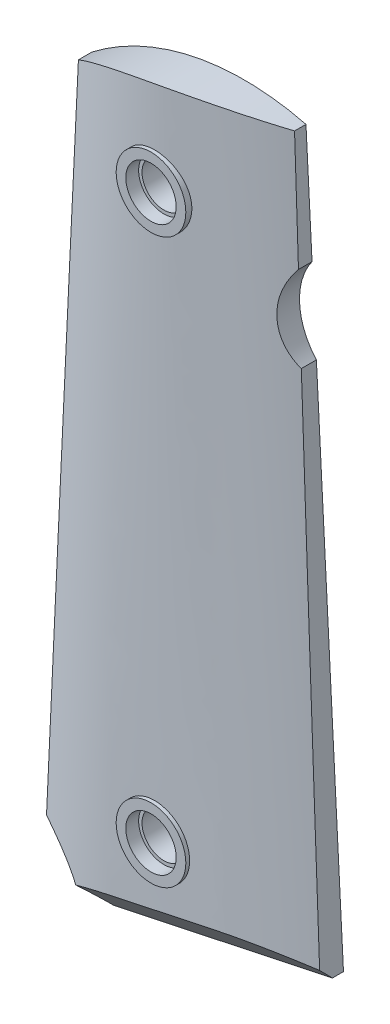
ISO-10303-21;
HEADER;
FILE_DESCRIPTION(('STEP AP214'),'2;1');
FILE_NAME('part.step','',(''),(''),'','','');
FILE_SCHEMA(('AUTOMOTIVE_DESIGN { 1 0 10303 214 1 1 1 1 }'));
ENDSEC;
DATA;
#1=APPLICATION_CONTEXT('core data for automotive mechanical design processes');
#2=APPLICATION_PROTOCOL_DEFINITION('international standard','automotive_design',2000,#1);
#3=PRODUCT_CONTEXT('',#1,'mechanical');
#4=PRODUCT('Part','Part','',(#3));
#5=PRODUCT_RELATED_PRODUCT_CATEGORY('part','',(#4));
#6=PRODUCT_DEFINITION_FORMATION('','',#4);
#7=PRODUCT_DEFINITION_CONTEXT('part definition',#1,'design');
#8=PRODUCT_DEFINITION('design','',#6,#7);
#9=PRODUCT_DEFINITION_SHAPE('','',#8);
#10=(LENGTH_UNIT() NAMED_UNIT(*) SI_UNIT(.MILLI.,.METRE.));
#11=(NAMED_UNIT(*) PLANE_ANGLE_UNIT() SI_UNIT($,.RADIAN.));
#12=(NAMED_UNIT(*) SI_UNIT($,.STERADIAN.) SOLID_ANGLE_UNIT());
#13=UNCERTAINTY_MEASURE_WITH_UNIT(LENGTH_MEASURE(1.E-05),#10,'distance_accuracy_value','');
#14=(GEOMETRIC_REPRESENTATION_CONTEXT(3) GLOBAL_UNCERTAINTY_ASSIGNED_CONTEXT((#13)) GLOBAL_UNIT_ASSIGNED_CONTEXT((#10,
#11,#12)) REPRESENTATION_CONTEXT('',''));
#15=CARTESIAN_POINT('',(0.,0.,0.));
#16=DIRECTION('',(0.,0.,1.));
#17=DIRECTION('',(1.,0.,0.));
#18=AXIS2_PLACEMENT_3D('',#15,#16,#17);
#19=CARTESIAN_POINT('',(89.8417994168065,0.,1.524));
#20=CARTESIAN_POINT('',(81.2358903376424,106.580725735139,1.524));
#21=CARTESIAN_POINT('',(88.7620034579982,0.,2.26298895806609));
#22=CARTESIAN_POINT('',(80.501620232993,106.580725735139,2.02231416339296));
#23=CARTESIAN_POINT('',(86.4893164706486,0.,3.57996667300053));
#24=CARTESIAN_POINT('',(78.9843663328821,106.58072573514,2.94421102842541));
#25=CARTESIAN_POINT('',(82.8212093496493,0.,5.02335652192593));
#26=CARTESIAN_POINT('',(76.5825585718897,106.580725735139,4.09164633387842));
#27=CARTESIAN_POINT('',(78.9819357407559,0.,5.90069462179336));
#28=CARTESIAN_POINT('',(74.0755735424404,106.58072573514,4.99357064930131));
#29=CARTESIAN_POINT('',(76.3697714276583,0.,6.096));
#30=CARTESIAN_POINT('',(72.3483346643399,106.580725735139,5.42513737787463));
#31=CARTESIAN_POINT('',(73.8147279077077,0.,6.096));
#32=CARTESIAN_POINT('',(70.6355501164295,106.580725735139,5.76227678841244));
#33=CARTESIAN_POINT('',(71.3192190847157,0.,6.096));
#34=CARTESIAN_POINT('',(68.9369860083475,106.58072573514,6.01213877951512));
#35=CARTESIAN_POINT('',(67.5865618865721,0.,6.096));
#36=CARTESIAN_POINT('',(66.3572201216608,106.580725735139,6.1379401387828));
#37=CARTESIAN_POINT('',(63.8539046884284,0.,6.096));
#38=CARTESIAN_POINT('',(63.777454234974,106.580725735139,6.01213877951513));
#39=CARTESIAN_POINT('',(61.3583958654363,0.,6.096));
#40=CARTESIAN_POINT('',(62.0788901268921,106.580725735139,5.76227678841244));
#41=CARTESIAN_POINT('',(58.8033523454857,0.,6.096));
#42=CARTESIAN_POINT('',(60.3661055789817,106.580725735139,5.42513737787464));
#43=CARTESIAN_POINT('',(56.191188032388,0.,5.90069462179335));
#44=CARTESIAN_POINT('',(58.6388667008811,106.58072573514,4.99357064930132));
#45=CARTESIAN_POINT('',(52.3519144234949,0.,5.02335652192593));
#46=CARTESIAN_POINT('',(56.1318816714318,106.580725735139,4.09164633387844));
#47=CARTESIAN_POINT('',(48.6838073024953,0.,3.57996667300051));
#48=CARTESIAN_POINT('',(53.7300739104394,106.58072573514,2.9442110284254));
#49=CARTESIAN_POINT('',(46.4111203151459,0.,2.26298895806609));
#50=CARTESIAN_POINT('',(52.2128200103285,106.580725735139,2.02231416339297));
#51=CARTESIAN_POINT('',(45.3313243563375,0.,1.524));
#52=CARTESIAN_POINT('',(51.4785499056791,106.580725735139,1.52400000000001));
#53=B_SPLINE_SURFACE_WITH_KNOTS('',3,1,((#19,#20),(#21,#22),(#23,#24),(#25,#26),(#27,#28),(#29,
#30),(#31,#32),(#33,#34),(#35,#36),(#37,#38),(#39,#40),(#41,#42),(#43,#44),(#45,#46),(#47,#48),
(#49,#50),(#51,#52)),.UNSPECIFIED.,.F.,.F.,.F.,(4,1,1,1,2,1,1,1,2,1,1,1,4),(2,2),(0.,
0.0844640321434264,0.168928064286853,0.253392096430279,0.337856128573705,0.418928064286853,0.5,
0.581071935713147,0.662143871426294,0.746607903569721,0.831071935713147,0.915535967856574,1.),
(0.,1.),.UNSPECIFIED.);
#54=CARTESIAN_POINT('',(61.5387170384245,93.2318088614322,5.72812234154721));
#55=CARTESIAN_POINT('',(61.5387153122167,93.0968646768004,5.72882926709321));
#56=CARTESIAN_POINT('',(61.5443789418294,92.9619495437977,5.7303795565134));
#57=CARTESIAN_POINT('',(61.5669863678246,92.6930538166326,5.73510136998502));
#58=CARTESIAN_POINT('',(61.5839326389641,92.5590734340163,5.73827324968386));
#59=CARTESIAN_POINT('',(61.6289956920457,92.2929542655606,5.74613461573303));
#60=CARTESIAN_POINT('',(61.6571205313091,92.1608168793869,5.75082519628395));
#61=CARTESIAN_POINT('',(61.7243398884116,91.8993673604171,5.76157835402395));
#62=CARTESIAN_POINT('',(61.7634384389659,91.7700562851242,5.76764143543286));
#63=CARTESIAN_POINT('',(61.8522593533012,91.5153677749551,5.78095080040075));
#64=CARTESIAN_POINT('',(61.9019693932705,91.3899859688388,5.78819570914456));
#65=CARTESIAN_POINT('',(62.0116987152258,91.1438258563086,5.80367031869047));
#66=CARTESIAN_POINT('',(62.0717217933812,91.0230492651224,5.81190038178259));
#67=CARTESIAN_POINT('',(62.2016003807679,90.7870455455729,5.82911210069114));
#68=CARTESIAN_POINT('',(62.2714506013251,90.6718154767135,5.83809335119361));
#69=CARTESIAN_POINT('',(62.4205439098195,90.4475839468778,5.85657514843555));
#70=CARTESIAN_POINT('',(62.4997904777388,90.3385848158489,5.86607588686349));
#71=CARTESIAN_POINT('',(62.6676419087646,90.1269302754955,5.88540850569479));
#72=CARTESIAN_POINT('',(62.756303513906,90.0243200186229,5.89524211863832));
#73=CARTESIAN_POINT('',(62.9419773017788,89.8268860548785,5.91493273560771));
#74=CARTESIAN_POINT('',(63.0389925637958,89.7320652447,5.92478974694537));
#75=CARTESIAN_POINT('',(63.240639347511,89.5509427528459,5.94427151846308));
#76=CARTESIAN_POINT('',(63.3452684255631,89.4646383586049,5.95389635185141));
#77=CARTESIAN_POINT('',(63.561484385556,89.3010908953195,5.97268148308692));
#78=CARTESIAN_POINT('',(63.6730738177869,89.2238511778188,5.98184160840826));
#79=CARTESIAN_POINT('',(63.9027448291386,89.0788013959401,5.99949519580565));
#80=CARTESIAN_POINT('',(64.0208449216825,89.0110203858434,6.00798657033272));
#81=CARTESIAN_POINT('',(64.2624429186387,88.8856324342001,6.02407061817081));
#82=CARTESIAN_POINT('',(64.3859428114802,88.8280292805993,6.0316629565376));
#83=CARTESIAN_POINT('',(64.6373744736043,88.7234729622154,6.04576217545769));
#84=CARTESIAN_POINT('',(64.7653044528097,88.6765155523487,6.05226948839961));
#85=CARTESIAN_POINT('',(65.0247739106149,88.5935559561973,6.06405241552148));
#86=CARTESIAN_POINT('',(65.1563146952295,88.5575577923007,6.06932757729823));
#87=CARTESIAN_POINT('',(65.421160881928,88.4970121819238,6.07849109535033));
#88=CARTESIAN_POINT('',(65.5544492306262,88.4723917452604,6.08238825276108));
#89=CARTESIAN_POINT('',(65.8226695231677,88.4344301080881,6.08876047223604));
#90=CARTESIAN_POINT('',(65.9576020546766,88.4210930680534,6.09123500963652));
#91=CARTESIAN_POINT('',(66.3633020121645,88.3982341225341,6.09642708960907));
#92=CARTESIAN_POINT('',(66.6352734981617,88.4057956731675,6.09692370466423));
#93=CARTESIAN_POINT('',(67.1721818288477,88.4662124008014,6.09200736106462));
#94=CARTESIAN_POINT('',(67.4371522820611,88.5187808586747,6.08663175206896));
#95=CARTESIAN_POINT('',(67.9545288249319,88.6672539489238,6.07064489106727));
#96=CARTESIAN_POINT('',(68.2069347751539,88.7631590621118,6.06003358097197));
#97=CARTESIAN_POINT('',(68.6925601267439,88.9957646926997,6.0346497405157));
#98=CARTESIAN_POINT('',(68.925740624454,89.1325454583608,6.01986902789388));
#99=CARTESIAN_POINT('',(69.3659377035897,89.4429455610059,5.98767346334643));
#100=CARTESIAN_POINT('',(69.5729530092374,89.6165666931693,5.9702584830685));
#101=CARTESIAN_POINT('',(69.9565456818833,89.9972167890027,5.93448332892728));
#102=CARTESIAN_POINT('',(70.1328885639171,90.2044815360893,5.91611715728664));
#103=CARTESIAN_POINT('',(70.448345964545,90.6457295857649,5.88055229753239));
#104=CARTESIAN_POINT('',(70.587459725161,90.8797134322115,5.86335363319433));
#105=CARTESIAN_POINT('',(70.8247758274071,91.3684490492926,5.83202799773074));
#106=CARTESIAN_POINT('',(70.9228840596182,91.6232470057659,5.81790812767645));
#107=CARTESIAN_POINT('',(71.074833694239,92.1459279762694,5.79448444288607));
#108=CARTESIAN_POINT('',(71.1286773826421,92.413810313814,5.78518037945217));
#109=CARTESIAN_POINT('',(71.1902458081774,92.9530822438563,5.77264471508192));
#110=CARTESIAN_POINT('',(71.1982875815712,93.2244346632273,5.76937147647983));
#111=CARTESIAN_POINT('',(71.1688323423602,93.7646500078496,5.76930263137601));
#112=CARTESIAN_POINT('',(71.1313373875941,94.0335130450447,5.77250673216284));
#113=CARTESIAN_POINT('',(71.0123054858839,94.5593720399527,5.7851115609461));
#114=CARTESIAN_POINT('',(70.9310452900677,94.8164316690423,5.79447343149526));
#115=CARTESIAN_POINT('',(70.7270471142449,95.3132690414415,5.81835373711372));
#116=CARTESIAN_POINT('',(70.6043076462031,95.5530461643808,5.83287235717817));
#117=CARTESIAN_POINT('',(70.3201749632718,96.0098151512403,5.86548208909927));
#118=CARTESIAN_POINT('',(70.1585990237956,96.2266921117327,5.88359001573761));
#119=CARTESIAN_POINT('',(69.8016250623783,96.6304207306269,5.92117190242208));
#120=CARTESIAN_POINT('',(69.6062249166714,96.8172705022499,5.94064594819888));
#121=CARTESIAN_POINT('',(69.1851206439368,97.1572951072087,5.97872939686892));
#122=CARTESIAN_POINT('',(68.9591694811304,97.3101653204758,5.99732988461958));
#123=CARTESIAN_POINT('',(68.4846137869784,97.5758045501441,6.0311033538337));
#124=CARTESIAN_POINT('',(68.2360098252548,97.6885745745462,6.04627642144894));
#125=CARTESIAN_POINT('',(67.7236479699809,97.8704683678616,6.07115902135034));
#126=CARTESIAN_POINT('',(67.4599327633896,97.9397090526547,6.08088318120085));
#127=CARTESIAN_POINT('',(67.0586093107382,98.0096045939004,6.0904194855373));
#128=CARTESIAN_POINT('',(66.9238056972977,98.0272425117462,6.09275649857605));
#129=CARTESIAN_POINT('',(66.6531866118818,98.0510904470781,6.09566765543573));
#130=CARTESIAN_POINT('',(66.5173715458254,98.05730482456,6.09624247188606));
#131=CARTESIAN_POINT('',(66.2470959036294,98.0582494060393,6.09559506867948));
#132=CARTESIAN_POINT('',(66.1126355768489,98.0530955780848,6.09439103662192));
#133=CARTESIAN_POINT('',(65.8446884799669,98.0315901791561,6.09024785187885));
#134=CARTESIAN_POINT('',(65.7112013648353,98.0152427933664,6.08730934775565));
#135=CARTESIAN_POINT('',(65.4460544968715,97.9714710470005,6.07977620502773));
#136=CARTESIAN_POINT('',(65.3143954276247,97.9440426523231,6.07518096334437));
#137=CARTESIAN_POINT('',(65.0539298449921,97.87832868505,6.06446801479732));
#138=CARTESIAN_POINT('',(64.9251223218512,97.8400470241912,6.05835085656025));
#139=CARTESIAN_POINT('',(64.6712246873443,97.7529118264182,6.04477146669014));
#140=CARTESIAN_POINT('',(64.5461341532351,97.7040594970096,6.03730938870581));
#141=CARTESIAN_POINT('',(64.3005620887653,97.5961554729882,6.0212600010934));
#142=CARTESIAN_POINT('',(64.1800789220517,97.5371074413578,6.01267309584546));
#143=CARTESIAN_POINT('',(63.9444497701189,97.4091956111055,5.99461802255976));
#144=CARTESIAN_POINT('',(63.829305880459,97.3403280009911,5.98514951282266));
#145=CARTESIAN_POINT('',(63.6052245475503,97.1933020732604,5.96561285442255));
#146=CARTESIAN_POINT('',(63.4962849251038,97.1151470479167,5.95554491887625));
#147=CARTESIAN_POINT('',(63.2841322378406,96.9491485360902,5.93498654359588));
#148=CARTESIAN_POINT('',(63.1809959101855,96.8612073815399,5.9244926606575));
#149=CARTESIAN_POINT('',(62.9825186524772,96.6769990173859,5.90350209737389));
#150=CARTESIAN_POINT('',(62.8871749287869,96.580734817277,5.89300541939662));
#151=CARTESIAN_POINT('',(62.7048466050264,96.3804552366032,5.87230614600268));
#152=CARTESIAN_POINT('',(62.6178670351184,96.2764352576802,5.86210373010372));
#153=CARTESIAN_POINT('',(62.4529723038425,96.0614509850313,5.84229929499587));
#154=CARTESIAN_POINT('',(62.3750537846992,95.9504892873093,5.83269705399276));
#155=CARTESIAN_POINT('',(62.2284242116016,95.7217695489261,5.81431780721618));
#156=CARTESIAN_POINT('',(62.159762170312,95.6039797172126,5.80554526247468));
#157=CARTESIAN_POINT('',(62.0326430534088,95.3629970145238,5.78913565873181));
#158=CARTESIAN_POINT('',(61.9741822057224,95.2398061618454,5.78149818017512));
#159=CARTESIAN_POINT('',(61.8679091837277,94.9889468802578,5.76757524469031));
#160=CARTESIAN_POINT('',(61.8200889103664,94.8612819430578,5.76128875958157));
#161=CARTESIAN_POINT('',(61.7354128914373,94.6023475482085,5.75023345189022));
#162=CARTESIAN_POINT('',(61.6985546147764,94.4710789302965,5.7454642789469));
#163=CARTESIAN_POINT('',(61.6246577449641,94.1573849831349,5.73612617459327));
#164=CARTESIAN_POINT('',(61.5924636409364,93.9737754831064,5.73226568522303));
#165=CARTESIAN_POINT('',(61.5494945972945,93.6040285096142,5.72777637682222));
#166=CARTESIAN_POINT('',(61.5387194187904,93.4178910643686,5.72714752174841));
#167=CARTESIAN_POINT('',(61.5387170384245,93.2318088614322,5.72812234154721));
#168=B_SPLINE_CURVE_WITH_KNOTS('',3,(#54,#55,#56,#57,#58,#59,#60,#61,#62,#63,#64,#65,#66,#67,
#68,#69,#70,#71,#72,#73,#74,#75,#76,#77,#78,#79,#80,#81,#82,#83,#84,#85,#86,#87,#88,#89,#90,#91,
#92,#93,#94,#95,#96,#97,#98,#99,#100,#101,#102,#103,#104,#105,#106,#107,#108,#109,#110,#111,
#112,#113,#114,#115,#116,#117,#118,#119,#120,#121,#122,#123,#124,#125,#126,#127,#128,#129,#130,
#131,#132,#133,#134,#135,#136,#137,#138,#139,#140,#141,#142,#143,#144,#145,#146,#147,#148,#149,
#150,#151,#152,#153,#154,#155,#156,#157,#158,#159,#160,#161,#162,#163,#164,#165,#166,#167),
.UNSPECIFIED.,.T.,.F.,(4,2,2,2,2,2,2,2,2,2,2,2,2,2,2,2,2,2,2,2,2,2,2,2,2,2,2,2,2,2,2,2,2,2,2,2,
2,2,2,2,2,2,2,2,2,2,2,2,2,2,2,2,2,2,2,2,4),(0.,0.404674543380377,0.809437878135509,
1.21449349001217,1.61969815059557,2.02443475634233,2.42932066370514,2.83398950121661,
3.23880868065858,3.64622330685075,4.05378876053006,4.46122397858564,4.86880936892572,
5.27762040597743,5.68658327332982,6.09538277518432,6.50433213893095,6.91062029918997,
7.31705820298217,8.12901705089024,8.93584143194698,9.74267476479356,10.5511026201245,
11.3595698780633,12.1739692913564,12.9883852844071,13.8046602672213,14.6208930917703,
15.431469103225,16.2420084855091,17.0474815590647,17.8529835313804,18.6623522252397,
19.4717717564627,20.2881785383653,21.1045647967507,21.9187488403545,22.3262595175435,
22.7336146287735,23.1368335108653,23.5399017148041,23.9431167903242,24.346186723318,
24.7492106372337,25.152090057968,25.5551262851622,25.9580200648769,26.365373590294,
26.7725804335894,27.1800306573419,27.5873294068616,27.9967065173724,28.4059319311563,
28.814844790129,29.2236631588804,29.7816981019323,30.339726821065),.UNSPECIFIED.);
#169=CARTESIAN_POINT('',(61.5387170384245,93.2318088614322,5.72812234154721));
#170=VERTEX_POINT('',#169);
#171=EDGE_CURVE('E376',#170,#170,#168,.T.);
#172=CARTESIAN_POINT('',(56.1628051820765,-1.41482962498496E-12,5.79699627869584));
#173=CARTESIAN_POINT('',(56.139338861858,0.237603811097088,5.79065360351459));
#174=CARTESIAN_POINT('',(56.1059685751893,0.474186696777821,5.78278718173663));
#175=CARTESIAN_POINT('',(56.0198054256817,0.943648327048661,5.76367703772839));
#176=CARTESIAN_POINT('',(55.9670127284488,1.17652710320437,5.75243334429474));
#177=CARTESIAN_POINT('',(55.8424121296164,1.63683947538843,5.72624346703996));
#178=CARTESIAN_POINT('',(55.7706110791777,1.86427500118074,5.71129861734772));
#179=CARTESIAN_POINT('',(55.6085731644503,2.31215629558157,5.67726290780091));
#180=CARTESIAN_POINT('',(55.5183367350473,2.53260222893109,5.65817214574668));
#181=CARTESIAN_POINT('',(55.3200872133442,2.96509977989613,5.61532717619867));
#182=CARTESIAN_POINT('',(55.2120597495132,3.17714443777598,5.59156919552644));
#183=CARTESIAN_POINT('',(54.9791977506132,3.59111742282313,5.53885580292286));
#184=CARTESIAN_POINT('',(54.8543633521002,3.79304583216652,5.50990043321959));
#185=CARTESIAN_POINT('',(54.5890438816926,4.18523922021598,5.44625139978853));
#186=CARTESIAN_POINT('',(54.4485666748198,4.37550998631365,5.41156061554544));
#187=CARTESIAN_POINT('',(54.1531737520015,4.74315336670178,5.33589195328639));
#188=CARTESIAN_POINT('',(53.9982582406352,4.92052616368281,5.29491416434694));
#189=CARTESIAN_POINT('',(53.6765523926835,5.25996629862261,5.2064932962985));
#190=CARTESIAN_POINT('',(53.5098535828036,5.4221328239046,5.15909788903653));
#191=CARTESIAN_POINT('',(53.1651593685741,5.73154354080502,5.05721813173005));
#192=CARTESIAN_POINT('',(52.9871639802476,5.87878775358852,5.00273379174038));
#193=CARTESIAN_POINT('',(52.6214697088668,6.15756687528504,4.88634858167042));
#194=CARTESIAN_POINT('',(52.4337678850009,6.2890969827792,4.8244454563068));
#195=CARTESIAN_POINT('',(52.0504361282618,6.53577858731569,4.69305868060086));
#196=CARTESIAN_POINT('',(51.8548063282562,6.65093035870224,4.62357515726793));
#197=CARTESIAN_POINT('',(51.4558746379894,6.86526937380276,4.47643803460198));
#198=CARTESIAN_POINT('',(51.2525263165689,6.96433079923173,4.39872722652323));
#199=CARTESIAN_POINT('',(50.8412936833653,7.14528294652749,4.23565075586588));
#200=CARTESIAN_POINT('',(50.6334089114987,7.22717191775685,4.15028431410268));
#201=CARTESIAN_POINT('',(50.2149597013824,7.37377373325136,3.97217911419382));
#202=CARTESIAN_POINT('',(50.0043971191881,7.43849786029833,3.87944525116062));
#203=CARTESIAN_POINT('',(49.5820933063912,7.5510744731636,3.68690248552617));
#204=CARTESIAN_POINT('',(49.370352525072,7.59893299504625,3.58709612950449));
#205=CARTESIAN_POINT('',(49.0263471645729,7.66337302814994,3.4194340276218));
#206=CARTESIAN_POINT('',(48.8940044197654,7.68495624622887,3.35360467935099));
#207=CARTESIAN_POINT('',(48.6299725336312,7.72178770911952,3.21958592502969));
#208=CARTESIAN_POINT('',(48.4982826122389,7.7370486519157,3.1514015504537));
#209=CARTESIAN_POINT('',(48.3669276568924,7.74924112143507,3.0820297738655));
#210=B_SPLINE_CURVE_WITH_KNOTS('',3,(#172,#173,#174,#175,#176,#177,#178,#179,#180,#181,#182,
#183,#184,#185,#186,#187,#188,#189,#190,#191,#192,#193,#194,#195,#196,#197,#198,#199,#200,#201,
#202,#203,#204,#205,#206,#207,#208,#209),.UNSPECIFIED.,.F.,.F.,(4,2,2,2,2,2,2,2,2,2,2,2,2,2,2,2,
2,2,4),(0.,0.716319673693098,1.43263323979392,2.14868897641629,2.86472782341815,
3.58134794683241,4.29796224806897,5.01421785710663,5.73046331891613,6.44165367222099,
7.15284301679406,7.8642491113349,8.57564328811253,9.29235711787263,10.0091439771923,
10.7254585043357,11.441516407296,11.8895104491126,12.3366003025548),.UNSPECIFIED.);
#211=CARTESIAN_POINT('',(54.8496701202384,3.79436844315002,5.50846863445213));
#212=VERTEX_POINT('',#211);
#213=CARTESIAN_POINT('',(48.3669276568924,7.74924112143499,3.08202977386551));
#214=VERTEX_POINT('',#213);
#215=EDGE_CURVE('E103',#212,#214,#210,.T.);
#216=CARTESIAN_POINT('',(48.1309495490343,6.03380731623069E-11,3.19391679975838));
#217=CARTESIAN_POINT('',(48.3998353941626,0.192796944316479,3.32659615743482));
#218=CARTESIAN_POINT('',(48.672431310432,0.382837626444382,3.45580811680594));
#219=CARTESIAN_POINT('',(49.2268078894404,0.758176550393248,3.70768361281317));
#220=CARTESIAN_POINT('',(49.5086368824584,0.943435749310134,3.83029891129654));
#221=CARTESIAN_POINT('',(50.0809006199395,1.30819691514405,4.06810884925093));
#222=CARTESIAN_POINT('',(50.3713658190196,1.48767226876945,4.18327112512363));
#223=CARTESIAN_POINT('',(50.9602707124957,1.8398800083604,4.40534206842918));
#224=CARTESIAN_POINT('',(51.2587242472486,2.01259921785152,4.5122349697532));
#225=CARTESIAN_POINT('',(51.8597127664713,2.34854504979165,4.71588704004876));
#226=CARTESIAN_POINT('',(52.1621685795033,2.51185419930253,4.8127433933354));
#227=CARTESIAN_POINT('',(52.7736274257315,2.83010663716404,4.99691180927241));
#228=CARTESIAN_POINT('',(53.0826188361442,2.98506328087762,5.08423935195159));
#229=CARTESIAN_POINT('',(53.7065055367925,3.28587507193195,5.24876434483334));
#230=CARTESIAN_POINT('',(54.0213811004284,3.43175531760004,5.32599044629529));
#231=CARTESIAN_POINT('',(54.49789234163,3.64334648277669,5.43388557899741));
#232=CARTESIAN_POINT('',(54.6571112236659,3.71254271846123,5.46846624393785));
#233=CARTESIAN_POINT('',(54.9771118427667,3.84855822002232,5.53497761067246));
#234=CARTESIAN_POINT('',(55.1378935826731,3.91537748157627,5.56690830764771));
#235=CARTESIAN_POINT('',(55.5696954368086,4.09069802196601,5.64862101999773));
#236=CARTESIAN_POINT('',(55.842085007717,4.19698770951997,5.69595504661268));
#237=CARTESIAN_POINT('',(56.3909208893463,4.40228107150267,5.78265285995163));
#238=CARTESIAN_POINT('',(56.6673679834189,4.50128331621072,5.82201508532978));
#239=CARTESIAN_POINT('',(57.0848062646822,4.64400865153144,5.87483123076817));
#240=CARTESIAN_POINT('',(57.2244258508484,4.69062454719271,5.89139991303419));
#241=CARTESIAN_POINT('',(57.5045427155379,4.78188126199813,5.92242287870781));
#242=CARTESIAN_POINT('',(57.6450399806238,4.82652211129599,5.93687719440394));
#243=CARTESIAN_POINT('',(57.926814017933,4.91376304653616,5.9636275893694));
#244=CARTESIAN_POINT('',(58.0680904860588,4.95636387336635,5.97592445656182));
#245=CARTESIAN_POINT('',(58.3514314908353,5.03949463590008,5.99832870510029));
#246=CARTESIAN_POINT('',(58.4934960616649,5.08002448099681,6.00843599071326));
#247=CARTESIAN_POINT('',(58.7790099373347,5.15914310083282,6.0264640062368));
#248=CARTESIAN_POINT('',(58.9224626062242,5.19772207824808,6.03437445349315));
#249=CARTESIAN_POINT('',(59.2100348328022,5.27268319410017,6.04790786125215));
#250=CARTESIAN_POINT('',(59.3541543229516,5.30906554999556,6.05353104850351));
#251=CARTESIAN_POINT('',(59.5708212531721,5.36196354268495,6.06022550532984));
#252=CARTESIAN_POINT('',(59.6431384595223,5.37932004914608,6.06216713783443));
#253=CARTESIAN_POINT('',(59.7879194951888,5.41346327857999,6.06546258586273));
#254=CARTESIAN_POINT('',(59.8603833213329,5.43025001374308,6.06681641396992));
#255=CARTESIAN_POINT('',(59.9691849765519,5.45500636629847,6.06841064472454));
#256=CARTESIAN_POINT('',(60.0054715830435,5.46318823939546,6.06886931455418));
#257=CARTESIAN_POINT('',(60.0780811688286,5.47939700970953,6.06962750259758));
#258=CARTESIAN_POINT('',(60.1144041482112,5.48742390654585,6.06992702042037));
#259=CARTESIAN_POINT('',(60.1870740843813,5.50337391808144,6.07041955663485));
#260=CARTESIAN_POINT('',(60.223421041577,5.51129703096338,6.07061257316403));
#261=CARTESIAN_POINT('',(60.2961096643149,5.52716669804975,6.07102263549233));
#262=CARTESIAN_POINT('',(60.3324513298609,5.53511325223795,6.07123968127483));
#263=CARTESIAN_POINT('',(60.441858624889,5.55902715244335,6.07188394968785));
#264=CARTESIAN_POINT('',(60.5149262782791,5.57498548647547,6.07230193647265));
#265=CARTESIAN_POINT('',(60.6610612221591,5.60690066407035,6.07313652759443));
#266=CARTESIAN_POINT('',(60.7341285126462,5.62285750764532,6.07355313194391));
#267=CARTESIAN_POINT('',(60.9533269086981,5.67071559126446,6.074791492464));
#268=CARTESIAN_POINT('',(61.099460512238,5.7026056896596,6.0756018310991));
#269=CARTESIAN_POINT('',(61.3917139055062,5.76635275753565,6.07719297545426));
#270=CARTESIAN_POINT('',(61.537833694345,5.79820973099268,6.07797378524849));
#271=CARTESIAN_POINT('',(61.8300824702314,5.8618906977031,6.07950123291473));
#272=CARTESIAN_POINT('',(61.9762114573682,5.89371469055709,6.08024787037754));
#273=CARTESIAN_POINT('',(62.2688230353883,5.95740133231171,6.0817054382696));
#274=CARTESIAN_POINT('',(62.4153056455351,5.98926389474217,6.08241628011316));
#275=CARTESIAN_POINT('',(62.7082793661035,6.05294858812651,6.08379664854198));
#276=CARTESIAN_POINT('',(62.8547704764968,6.08477071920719,6.08446617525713));
#277=CARTESIAN_POINT('',(63.2942704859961,6.18017393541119,6.08640741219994));
#278=CARTESIAN_POINT('',(63.5872939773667,6.24368921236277,6.0876117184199));
#279=CARTESIAN_POINT('',(64.1734898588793,6.37053806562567,6.08981164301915));
#280=CARTESIAN_POINT('',(64.4666622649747,6.43387156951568,6.09080718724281));
#281=CARTESIAN_POINT('',(65.0530548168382,6.56030611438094,6.09256096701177));
#282=CARTESIAN_POINT('',(65.3462749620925,6.62340715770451,6.09331920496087));
#283=CARTESIAN_POINT('',(65.9360358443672,6.75005084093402,6.09457723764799));
#284=CARTESIAN_POINT('',(66.2325772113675,6.81359057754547,6.0950740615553));
#285=CARTESIAN_POINT('',(66.8257240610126,6.94037666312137,6.09576740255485));
#286=CARTESIAN_POINT('',(67.1223295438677,7.00362301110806,6.09596391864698));
#287=CARTESIAN_POINT('',(67.7147306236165,7.12960683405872,6.0960275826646));
#288=CARTESIAN_POINT('',(68.0105260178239,7.19234526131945,6.09589570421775));
#289=CARTESIAN_POINT('',(68.6021884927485,7.31747530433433,6.09527781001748));
#290=CARTESIAN_POINT('',(68.8980555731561,7.37986692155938,6.0947917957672));
#291=CARTESIAN_POINT('',(69.4890790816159,7.50411207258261,6.09344119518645));
#292=CARTESIAN_POINT('',(69.7842353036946,7.56596659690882,6.0925776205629));
#293=CARTESIAN_POINT('',(70.3746333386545,7.6892809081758,6.09044656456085));
#294=CARTESIAN_POINT('',(70.6698751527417,7.75074068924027,6.0891790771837));
#295=CARTESIAN_POINT('',(71.2597575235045,7.87309727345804,6.08621843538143));
#296=CARTESIAN_POINT('',(71.554397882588,7.93399505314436,6.08452627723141));
#297=CARTESIAN_POINT('',(72.1437491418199,8.05534580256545,6.08069220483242));
#298=CARTESIAN_POINT('',(72.4384600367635,8.11579879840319,6.07855031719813));
#299=CARTESIAN_POINT('',(72.880283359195,8.20606794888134,6.07498663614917));
#300=CARTESIAN_POINT('',(73.0273617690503,8.23605775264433,6.07374176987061));
#301=CARTESIAN_POINT('',(73.3215396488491,8.2959191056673,6.07113198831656));
#302=CARTESIAN_POINT('',(73.4686391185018,8.32579065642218,6.06976707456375));
#303=CARTESIAN_POINT('',(73.762893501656,8.38542060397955,6.06691503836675));
#304=CARTESIAN_POINT('',(73.9100484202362,8.41517897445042,6.06542788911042));
#305=CARTESIAN_POINT('',(74.130801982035,8.45972350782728,6.06310177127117));
#306=CARTESIAN_POINT('',(74.2043916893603,8.47455651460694,6.06231048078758));
#307=CARTESIAN_POINT('',(74.3515770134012,8.50419448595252,6.06069924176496));
#308=CARTESIAN_POINT('',(74.4251726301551,8.5189994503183,6.05987929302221));
#309=CARTESIAN_POINT('',(74.5723360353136,8.54855994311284,6.0581968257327));
#310=CARTESIAN_POINT('',(74.6459038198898,8.56331549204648,6.0573343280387));
#311=CARTESIAN_POINT('',(74.7562540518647,8.58545569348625,6.05604760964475));
#312=CARTESIAN_POINT('',(74.7930370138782,8.59283686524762,6.05561987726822));
#313=CARTESIAN_POINT('',(74.8666339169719,8.60743079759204,6.05459324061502));
#314=CARTESIAN_POINT('',(74.9034478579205,8.61464355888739,6.05399433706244));
#315=CARTESIAN_POINT('',(75.0139243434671,8.63604560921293,6.05195934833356));
#316=CARTESIAN_POINT('',(75.0876282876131,8.65000002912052,6.05028491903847));
#317=CARTESIAN_POINT('',(75.235137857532,8.67726932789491,6.0462893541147));
#318=CARTESIAN_POINT('',(75.308943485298,8.6905841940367,6.04396820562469));
#319=CARTESIAN_POINT('',(75.5304196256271,8.72955411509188,6.03603906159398));
#320=CARTESIAN_POINT('',(75.6782267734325,8.75424948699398,6.02946394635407));
#321=CARTESIAN_POINT('',(75.9741207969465,8.80105218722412,6.01372406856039));
#322=CARTESIAN_POINT('',(76.1222076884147,8.82315936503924,6.00455915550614));
#323=CARTESIAN_POINT('',(76.3808958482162,8.8594735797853,5.98629552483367));
#324=CARTESIAN_POINT('',(76.4914569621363,8.87426032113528,5.977772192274));
#325=CARTESIAN_POINT('',(76.7126583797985,8.90237400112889,5.95928116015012));
#326=CARTESIAN_POINT('',(76.8232986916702,8.91570075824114,5.94931328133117));
#327=CARTESIAN_POINT('',(77.0446163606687,8.94088566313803,5.92793330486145));
#328=CARTESIAN_POINT('',(77.1552937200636,8.9527436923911,5.91652109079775));
#329=CARTESIAN_POINT('',(77.3766317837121,8.97498246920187,5.89225512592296));
#330=CARTESIAN_POINT('',(77.4872924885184,8.98536328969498,5.87940144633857));
#331=CARTESIAN_POINT('',(77.8192204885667,9.01428383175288,5.83867829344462));
#332=CARTESIAN_POINT('',(78.0404247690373,9.03060062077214,5.80864756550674));
#333=CARTESIAN_POINT('',(78.4823363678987,9.05726618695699,5.7428518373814));
#334=CARTESIAN_POINT('',(78.7030436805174,9.06761489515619,5.70708677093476));
#335=CARTESIAN_POINT('',(79.1436564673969,9.08234335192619,5.6298848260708));
#336=CARTESIAN_POINT('',(79.3635619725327,9.08672333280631,5.58844816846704));
#337=CARTESIAN_POINT('',(79.7995281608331,9.08952694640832,5.5005480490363));
#338=CARTESIAN_POINT('',(80.0156024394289,9.08802471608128,5.45415427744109));
#339=CARTESIAN_POINT('',(80.4465204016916,9.0792680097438,5.35599604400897));
#340=CARTESIAN_POINT('',(80.6613634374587,9.07201074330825,5.30422898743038));
#341=CARTESIAN_POINT('',(81.0895164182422,9.05179205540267,5.1954341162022));
#342=CARTESIAN_POINT('',(81.3028258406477,9.03882877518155,5.13840459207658));
#343=CARTESIAN_POINT('',(81.7276175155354,9.00726334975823,5.01920979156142));
#344=CARTESIAN_POINT('',(81.939099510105,8.98866042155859,4.95704380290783));
#345=CARTESIAN_POINT('',(82.3599363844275,8.94589732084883,4.82771827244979));
#346=CARTESIAN_POINT('',(82.5692914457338,8.92173762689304,4.76055916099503));
#347=CARTESIAN_POINT('',(83.1240061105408,8.85010701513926,4.57516218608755));
#348=CARTESIAN_POINT('',(83.4673282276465,8.79781187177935,4.45262913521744));
#349=CARTESIAN_POINT('',(84.1464956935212,8.67872947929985,4.19494212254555));
#350=CARTESIAN_POINT('',(84.4823431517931,8.61194637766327,4.05979177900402));
#351=CARTESIAN_POINT('',(85.145900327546,8.46449963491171,3.77760580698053));
#352=CARTESIAN_POINT('',(85.4736098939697,8.38383573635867,3.63056995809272));
#353=CARTESIAN_POINT('',(86.1219516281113,8.20880204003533,3.32456334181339));
#354=CARTESIAN_POINT('',(86.4425358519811,8.11436037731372,3.16553224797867));
#355=CARTESIAN_POINT('',(87.0742657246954,7.91286761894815,2.83709856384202));
#356=CARTESIAN_POINT('',(87.3854114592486,7.80581663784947,2.66769606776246));
#357=CARTESIAN_POINT('',(87.9977518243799,7.57990072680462,2.31940424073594));
#358=CARTESIAN_POINT('',(88.298950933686,7.46104121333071,2.14051927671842));
#359=CARTESIAN_POINT('',(88.7098335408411,7.28841051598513,1.88623367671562));
#360=CARTESIAN_POINT('',(88.8238394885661,7.2393564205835,1.81454836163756));
#361=CARTESIAN_POINT('',(89.0499891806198,7.13976241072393,1.67011155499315));
#362=CARTESIAN_POINT('',(89.1621373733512,7.08922722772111,1.59736376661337));
#363=CARTESIAN_POINT('',(89.2735210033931,7.03789979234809,1.524));
#364=B_SPLINE_CURVE_WITH_KNOTS('',3,(#216,#217,#218,#219,#220,#221,#222,#223,#224,#225,#226,
#227,#228,#229,#230,#231,#232,#233,#234,#235,#236,#237,#238,#239,#240,#241,#242,#243,#244,#245,
#246,#247,#248,#249,#250,#251,#252,#253,#254,#255,#256,#257,#258,#259,#260,#261,#262,#263,#264,
#265,#266,#267,#268,#269,#270,#271,#272,#273,#274,#275,#276,#277,#278,#279,#280,#281,#282,#283,
#284,#285,#286,#287,#288,#289,#290,#291,#292,#293,#294,#295,#296,#297,#298,#299,#300,#301,#302,
#303,#304,#305,#306,#307,#308,#309,#310,#311,#312,#313,#314,#315,#316,#317,#318,#319,#320,#321,
#322,#323,#324,#325,#326,#327,#328,#329,#330,#331,#332,#333,#334,#335,#336,#337,#338,#339,#340,
#341,#342,#343,#344,#345,#346,#347,#348,#349,#350,#351,#352,#353,#354,#355,#356,#357,#358,#359,
#360,#361,#362,#363),.UNSPECIFIED.,.F.,.F.,(4,2,2,2,2,2,2,2,2,2,2,2,2,2,2,2,2,2,2,2,2,2,2,2,2,2,
2,2,2,2,2,2,2,2,2,2,2,2,2,2,2,2,2,2,2,2,2,2,2,2,2,2,2,2,2,2,2,2,2,2,2,2,2,2,2,2,2,2,2,2,2,2,2,
4),(0.,1.06940238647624,2.14578371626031,3.226562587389,4.30935369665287,5.38042186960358,
6.44972328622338,7.51592279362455,8.04693389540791,8.57794596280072,9.46632043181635,
10.3548687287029,10.7992198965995,11.2435642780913,11.6877460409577,12.1319472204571,
12.5781937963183,13.0243961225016,13.2475810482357,13.4707611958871,13.5823619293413,
13.6939629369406,13.8055658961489,13.9171687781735,14.1415424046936,14.3659139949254,
14.8146388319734,15.2633015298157,15.7119695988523,16.1616983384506,16.6114256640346,
17.5109174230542,18.4107281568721,19.3105297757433,20.2203475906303,21.1301684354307,
22.0372950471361,22.9444178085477,23.8491246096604,24.7538448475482,25.6564621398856,
26.5590260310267,27.009355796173,27.4596798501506,27.9101029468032,28.1353246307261,
28.3605479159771,28.5856618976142,28.6982176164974,28.8107728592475,29.035862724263,
29.2609570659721,29.7109093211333,30.1608877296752,30.4964819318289,30.8321178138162,
31.1677807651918,31.5034271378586,32.1747468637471,32.8460743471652,33.517375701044,
34.1802436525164,34.8434332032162,35.5068389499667,36.170336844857,36.8337776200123,
37.9379330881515,39.0417728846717,40.145633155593,41.2554719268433,42.3653006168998,
43.4746225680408,43.9045840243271,44.3332961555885),.UNSPECIFIED.);
#365=CARTESIAN_POINT('',(86.3427091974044,8.14172510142,3.21305411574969));
#366=VERTEX_POINT('',#365);
#367=EDGE_CURVE('E285',#212,#366,#364,.T.);
#368=CARTESIAN_POINT('',(82.680301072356,77.972722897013,2.08778684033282));
#369=CARTESIAN_POINT('',(83.1203732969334,69.5818823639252,2.23600989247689));
#370=CARTESIAN_POINT('',(83.5604503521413,61.1909497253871,2.37892515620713));
#371=CARTESIAN_POINT('',(84.4406121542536,44.4089377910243,2.65547885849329));
#372=CARTESIAN_POINT('',(84.8806969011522,36.0178584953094,2.78911730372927));
#373=CARTESIAN_POINT('',(85.5060321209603,24.0946154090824,2.97336892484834));
#374=CARTESIAN_POINT('',(85.6912799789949,20.5625014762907,3.02724780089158));
#375=CARTESIAN_POINT('',(86.0617767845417,13.4982528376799,3.13369483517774));
#376=CARTESIAN_POINT('',(86.2470257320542,9.9661181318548,3.18626299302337));
#377=CARTESIAN_POINT('',(86.4322751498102,6.43397445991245,3.23822364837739));
#378=B_SPLINE_CURVE_WITH_KNOTS('',3,(#368,#369,#370,#371,#372,#373,#374,#375,#376,#377),
.UNSPECIFIED.,.F.,.F.,(4,2,2,2,4),(0.,25.2110366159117,50.4220550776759,61.0341912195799,
71.6463305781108),.UNSPECIFIED.);
#379=CARTESIAN_POINT('',(82.680301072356,77.972722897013,2.08778684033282));
#380=VERTEX_POINT('',#379);
#381=EDGE_CURVE('E293',#380,#366,#378,.T.);
#382=CARTESIAN_POINT('',(82.0779256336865,89.458192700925,1.88163341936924));
#383=CARTESIAN_POINT('',(81.9498732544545,89.2817942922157,1.97323411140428));
#384=CARTESIAN_POINT('',(81.8269475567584,89.0990561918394,2.05986799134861));
#385=CARTESIAN_POINT('',(81.5928446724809,88.7219039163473,2.22315624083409));
#386=CARTESIAN_POINT('',(81.4816702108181,88.527487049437,2.29980829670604));
#387=CARTESIAN_POINT('',(81.2725938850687,88.1280025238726,2.44306630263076));
#388=CARTESIAN_POINT('',(81.1746960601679,87.9229316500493,2.50966919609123));
#389=CARTESIAN_POINT('',(80.9935677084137,87.5035277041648,2.63283121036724));
#390=CARTESIAN_POINT('',(80.9103356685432,87.2891955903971,2.68939136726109));
#391=CARTESIAN_POINT('',(80.759542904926,86.8522723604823,2.79266999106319));
#392=CARTESIAN_POINT('',(80.6920141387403,86.6296654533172,2.83936837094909));
#393=CARTESIAN_POINT('',(80.5738095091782,86.1782156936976,2.92290638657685));
#394=CARTESIAN_POINT('',(80.5231333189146,85.9493729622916,2.95974621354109));
#395=CARTESIAN_POINT('',(80.4394001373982,85.487302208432,3.02368684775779));
#396=CARTESIAN_POINT('',(80.4063317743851,85.2540771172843,3.05079393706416));
#397=CARTESIAN_POINT('',(80.3582753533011,84.7848687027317,3.09542875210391));
#398=CARTESIAN_POINT('',(80.3432866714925,84.5488854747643,3.11295680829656));
#399=CARTESIAN_POINT('',(80.3318193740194,84.0822151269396,3.13819108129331));
#400=CARTESIAN_POINT('',(80.3348616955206,83.8515530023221,3.1461448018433));
#401=CARTESIAN_POINT('',(80.3583914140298,83.3909850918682,3.15310939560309));
#402=CARTESIAN_POINT('',(80.3788786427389,83.1610792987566,3.15212035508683));
#403=CARTESIAN_POINT('',(80.4371487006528,82.7036282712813,3.14119581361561));
#404=CARTESIAN_POINT('',(80.4749357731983,82.4760836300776,3.13125811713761));
#405=CARTESIAN_POINT('',(80.5674458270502,82.0250492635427,3.10238356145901));
#406=CARTESIAN_POINT('',(80.6221684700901,81.8015594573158,3.0834468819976));
#407=CARTESIAN_POINT('',(80.747523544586,81.361845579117,3.03665643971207));
#408=CARTESIAN_POINT('',(80.8180356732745,81.145580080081,3.00886946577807));
#409=CARTESIAN_POINT('',(80.9744501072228,80.7200856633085,2.94422162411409));
#410=CARTESIAN_POINT('',(81.0603525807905,80.5108568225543,2.90736065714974));
#411=CARTESIAN_POINT('',(81.2465762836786,80.1009245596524,2.82445468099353));
#412=CARTESIAN_POINT('',(81.3468908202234,79.9002172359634,2.77841393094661));
#413=CARTESIAN_POINT('',(81.5608191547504,79.5085709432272,2.67704017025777));
#414=CARTESIAN_POINT('',(81.6744291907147,79.3176292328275,2.62170978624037));
#415=CARTESIAN_POINT('',(81.9281423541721,78.9242159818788,2.49441459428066));
#416=CARTESIAN_POINT('',(82.0697884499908,78.7231197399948,2.42124950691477));
#417=CARTESIAN_POINT('',(82.2919334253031,78.4329251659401,2.30272817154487));
#418=CARTESIAN_POINT('',(82.3675242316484,78.3381796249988,2.26179830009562));
#419=CARTESIAN_POINT('',(82.5217154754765,78.1525396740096,2.17699884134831));
#420=CARTESIAN_POINT('',(82.6003157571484,78.0616450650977,2.13312940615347));
#421=CARTESIAN_POINT('',(82.680301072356,77.972722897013,2.08778684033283));
#422=B_SPLINE_CURVE_WITH_KNOTS('',3,(#382,#383,#384,#385,#386,#387,#388,#389,#390,#391,#392,
#393,#394,#395,#396,#397,#398,#399,#400,#401,#402,#403,#404,#405,#406,#407,#408,#409,#410,#411,
#412,#413,#414,#415,#416,#417,#418,#419,#420,#421),.UNSPECIFIED.,.F.,.F.,(4,2,2,2,2,2,2,2,2,2,2,
2,2,2,2,2,2,2,2,4),(0.,0.709177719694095,1.41851952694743,2.12807665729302,2.8375605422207,
3.54847589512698,4.25937745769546,4.96981933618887,5.68023670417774,6.37186522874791,
7.06348708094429,7.75527866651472,8.44705643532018,9.1337326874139,9.82041644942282,
10.5067823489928,11.1929545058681,11.9616534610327,12.34533401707,12.7289947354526),.UNSPECIFIED.);
#423=CARTESIAN_POINT('',(82.0779256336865,89.458192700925,1.88163341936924));
#424=VERTEX_POINT('',#423);
#425=EDGE_CURVE('E303',#424,#380,#422,.T.);
#426=CARTESIAN_POINT('',(81.2358903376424,105.513247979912,1.58225544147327));
#427=CARTESIAN_POINT('',(81.3762284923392,102.837425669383,1.63323997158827));
#428=CARTESIAN_POINT('',(81.5165671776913,100.161593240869,1.68368040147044));
#429=CARTESIAN_POINT('',(81.797245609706,94.8099081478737,1.7834730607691));
#430=CARTESIAN_POINT('',(81.9375853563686,92.1340554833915,1.83282529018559));
#431=CARTESIAN_POINT('',(82.0779256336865,89.458192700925,1.88163341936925));
#432=B_SPLINE_CURVE_WITH_KNOTS('',3,(#426,#427,#428,#429,#430,#431),.UNSPECIFIED.,.F.,.F.,(4,2,
4),(0.,8.03995431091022,16.0799086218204),.UNSPECIFIED.);
#433=CARTESIAN_POINT('',(81.2358903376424,105.513247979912,1.58225544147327));
#434=VERTEX_POINT('',#433);
#435=EDGE_CURVE('E306',#434,#424,#432,.T.);
#436=CARTESIAN_POINT('',(51.5570684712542,99.3431689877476,1.85265677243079));
#437=CARTESIAN_POINT('',(51.9278080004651,99.6304304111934,2.08157820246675));
#438=CARTESIAN_POINT('',(52.3069685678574,99.9121248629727,2.30398753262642));
#439=CARTESIAN_POINT('',(53.082537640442,100.463688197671,2.73479721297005));
#440=CARTESIAN_POINT('',(53.4789714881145,100.733538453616,2.94317575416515));
#441=CARTESIAN_POINT('',(54.2885666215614,101.259972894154,3.34433510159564));
#442=CARTESIAN_POINT('',(54.7017361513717,101.516550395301,3.53710807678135));
#443=CARTESIAN_POINT('',(55.5482320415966,102.017450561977,3.90725426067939));
#444=CARTESIAN_POINT('',(55.9817121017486,102.261634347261,4.0844645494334));
#445=CARTESIAN_POINT('',(56.8643854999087,102.73371735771,4.41976419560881));
#446=CARTESIAN_POINT('',(57.3135715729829,102.961623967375,4.57786224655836));
#447=CARTESIAN_POINT('',(58.2269187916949,103.399890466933,4.87335278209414));
#448=CARTESIAN_POINT('',(58.691075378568,103.610255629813,5.01075149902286));
#449=CARTESIAN_POINT('',(59.5485051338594,103.975967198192,5.24044509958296));
#450=CARTESIAN_POINT('',(59.9394806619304,104.134397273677,5.33640613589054));
#451=CARTESIAN_POINT('',(60.5324344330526,104.362021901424,5.46838263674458));
#452=CARTESIAN_POINT('',(60.7311793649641,104.43623078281,5.51038275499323));
#453=CARTESIAN_POINT('',(61.1307342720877,104.581225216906,5.5902672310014));
#454=CARTESIAN_POINT('',(61.3315442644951,104.652010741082,5.62815155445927));
#455=CARTESIAN_POINT('',(61.936872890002,104.859094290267,5.73571919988));
#456=CARTESIAN_POINT('',(62.3443115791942,104.990127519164,5.79932195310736));
#457=CARTESIAN_POINT('',(63.164095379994,105.236966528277,5.90870583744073));
#458=CARTESIAN_POINT('',(63.5764100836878,105.352838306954,5.95456603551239));
#459=CARTESIAN_POINT('',(64.4066160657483,105.569506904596,6.02771942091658));
#460=CARTESIAN_POINT('',(64.8245071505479,105.67030424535,6.05501325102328));
#461=CARTESIAN_POINT('',(65.6645360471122,105.856364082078,6.09011765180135));
#462=CARTESIAN_POINT('',(66.0866736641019,105.941627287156,6.09792911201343));
#463=CARTESIAN_POINT('',(66.9361801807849,106.096730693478,6.09326687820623));
#464=CARTESIAN_POINT('',(67.3635652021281,106.166479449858,6.08067635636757));
#465=CARTESIAN_POINT('',(68.2195838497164,106.289736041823,6.03453081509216));
#466=CARTESIAN_POINT('',(68.6482175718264,106.343242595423,6.00097414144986));
#467=CARTESIAN_POINT('',(69.5050098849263,106.433982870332,5.91261323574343));
#468=CARTESIAN_POINT('',(69.9331684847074,106.471216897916,5.85780940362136));
#469=CARTESIAN_POINT('',(70.7887478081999,106.529667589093,5.72684041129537));
#470=CARTESIAN_POINT('',(71.2161615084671,106.550831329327,5.65060579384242));
#471=CARTESIAN_POINT('',(72.0672011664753,106.577280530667,5.4771401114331));
#472=CARTESIAN_POINT('',(72.4908270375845,106.582565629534,5.37990856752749));
#473=CARTESIAN_POINT('',(73.3327486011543,106.577761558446,5.16503450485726));
#474=CARTESIAN_POINT('',(73.7510447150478,106.567673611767,5.04739361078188));
#475=CARTESIAN_POINT('',(74.4818072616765,106.536947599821,4.82279981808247));
#476=CARTESIAN_POINT('',(74.7956943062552,106.519403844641,4.72000217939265));
#477=CARTESIAN_POINT('',(75.4190320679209,106.476124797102,4.50326881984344));
#478=CARTESIAN_POINT('',(75.728482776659,106.450389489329,4.38933307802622));
#479=CARTESIAN_POINT('',(76.3424656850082,106.391092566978,4.15063460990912));
#480=CARTESIAN_POINT('',(76.646997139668,106.357529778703,4.02587026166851));
#481=CARTESIAN_POINT('',(77.2506831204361,106.282973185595,3.76584235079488));
#482=CARTESIAN_POINT('',(77.5498366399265,106.241978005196,3.6305768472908));
#483=CARTESIAN_POINT('',(78.1412454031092,106.153141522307,3.35040852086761));
#484=CARTESIAN_POINT('',(78.4335212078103,106.105324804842,3.2055412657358));
#485=CARTESIAN_POINT('',(79.011852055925,106.003183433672,2.90609082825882));
#486=CARTESIAN_POINT('',(79.2979077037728,105.948859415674,2.7515085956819));
#487=CARTESIAN_POINT('',(79.8633844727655,105.834176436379,2.4330091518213));
#488=CARTESIAN_POINT('',(80.142808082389,105.773819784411,2.26909552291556));
#489=CARTESIAN_POINT('',(80.6946296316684,105.647572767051,1.93232570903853));
#490=CARTESIAN_POINT('',(80.9670328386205,105.581686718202,1.75947653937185));
#491=CARTESIAN_POINT('',(81.2358903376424,105.513247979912,1.58225544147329));
#492=B_SPLINE_CURVE_WITH_KNOTS('',3,(#436,#437,#438,#439,#440,#441,#442,#443,#444,#445,#446,
#447,#448,#449,#450,#451,#452,#453,#454,#455,#456,#457,#458,#459,#460,#461,#462,#463,#464,#465,
#466,#467,#468,#469,#470,#471,#472,#473,#474,#475,#476,#477,#478,#479,#480,#481,#482,#483,#484,
#485,#486,#487,#488,#489,#490,#491),.UNSPECIFIED.,.F.,.F.,(4,2,2,2,2,2,2,2,2,2,2,2,2,2,2,2,2,2,
2,2,2,2,2,2,2,2,2,4),(0.,1.56563157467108,3.13364306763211,4.70243659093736,6.28606979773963,
7.86897992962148,9.45141250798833,10.7487117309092,11.3974379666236,12.0461696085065,
13.3435627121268,14.6351056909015,15.9266039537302,17.2180432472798,18.5169038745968,
19.8158669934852,21.1148056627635,22.418003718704,23.721231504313,25.0243555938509,
26.0163214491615,27.0082891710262,28.0004057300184,28.9927060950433,29.9815165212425,
30.970230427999,31.9585672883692,32.9461396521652),.UNSPECIFIED.);
#493=CARTESIAN_POINT('',(51.5570684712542,99.3431689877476,1.8526567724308));
#494=VERTEX_POINT('',#493);
#495=EDGE_CURVE('E1065',#494,#434,#492,.T.);
#496=CARTESIAN_POINT('',(48.3669276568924,7.74924112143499,3.08202977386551));
#497=CARTESIAN_POINT('',(48.6594212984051,16.1471906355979,2.97906090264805));
#498=CARTESIAN_POINT('',(48.9519140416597,24.5451143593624,2.87393458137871));
#499=CARTESIAN_POINT('',(49.5368970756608,41.3408913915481,2.65848924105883));
#500=CARTESIAN_POINT('',(49.8293873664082,49.7387446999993,2.54817022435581));
#501=CARTESIAN_POINT('',(50.3610769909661,65.004384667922,2.34211345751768));
#502=CARTESIAN_POINT('',(50.6002767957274,71.8721848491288,2.24738094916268));
#503=CARTESIAN_POINT('',(51.0786743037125,85.607724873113,2.053459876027));
#504=CARTESIAN_POINT('',(51.3178720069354,92.4754647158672,1.95427130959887));
#505=CARTESIAN_POINT('',(51.5570684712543,99.3431689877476,1.85265677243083));
#506=B_SPLINE_CURVE_WITH_KNOTS('',3,(#496,#497,#498,#499,#500,#501,#502,#503,#504,#505),
.UNSPECIFIED.,.F.,.F.,(4,2,2,2,4),(0.,25.2110181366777,50.422024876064,71.0398757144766,
91.6577341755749),.UNSPECIFIED.);
#507=EDGE_CURVE('E366',#214,#494,#506,.T.);
#508=CARTESIAN_POINT('',(61.5387170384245,15.1522088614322,6.04792843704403));
#509=CARTESIAN_POINT('',(61.5387160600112,15.0166224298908,6.04837300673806));
#510=CARTESIAN_POINT('',(61.5444333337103,14.8810523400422,6.048910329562));
#511=CARTESIAN_POINT('',(61.5672623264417,14.6108312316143,6.05014941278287));
#512=CARTESIAN_POINT('',(61.5843770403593,14.4761804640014,6.05085121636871));
#513=CARTESIAN_POINT('',(61.6299035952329,14.2086820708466,6.05239540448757));
#514=CARTESIAN_POINT('',(61.6583254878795,14.0758361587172,6.05323791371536));
#515=CARTESIAN_POINT('',(61.7262759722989,13.8129641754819,6.05503671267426));
#516=CARTESIAN_POINT('',(61.7658086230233,13.6829391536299,6.05599304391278));
#517=CARTESIAN_POINT('',(61.8556565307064,13.4267945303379,6.05799064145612));
#518=CARTESIAN_POINT('',(61.9059626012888,13.3006717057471,6.05903183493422));
#519=CARTESIAN_POINT('',(62.0170400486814,13.0530663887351,6.06117258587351));
#520=CARTESIAN_POINT('',(62.0778152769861,12.9315856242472,6.06227216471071));
#521=CARTESIAN_POINT('',(62.2093452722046,12.6942509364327,6.06450187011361));
#522=CARTESIAN_POINT('',(62.2800938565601,12.5783935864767,6.06563197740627));
#523=CARTESIAN_POINT('',(62.4311242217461,12.3530067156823,6.06789877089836));
#524=CARTESIAN_POINT('',(62.5114095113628,12.2434795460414,6.06903545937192));
#525=CARTESIAN_POINT('',(62.6809053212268,12.0315984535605,6.07129199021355));
#526=CARTESIAN_POINT('',(62.7701141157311,11.9292431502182,6.07241183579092));
#527=CARTESIAN_POINT('',(62.9568705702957,11.732373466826,6.07461520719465));
#528=CARTESIAN_POINT('',(63.054421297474,11.6378619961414,6.07569871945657));
#529=CARTESIAN_POINT('',(63.257106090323,11.4574241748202,6.07781140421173));
#530=CARTESIAN_POINT('',(63.3622376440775,11.3714950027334,6.07884059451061));
#531=CARTESIAN_POINT('',(63.5794056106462,11.2087670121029,6.08083110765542));
#532=CARTESIAN_POINT('',(63.6914445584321,11.1319715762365,6.0817924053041));
#533=CARTESIAN_POINT('',(63.9215497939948,10.9881228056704,6.08363487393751));
#534=CARTESIAN_POINT('',(64.0396136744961,10.9210656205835,6.08451607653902));
#535=CARTESIAN_POINT('',(64.2810150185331,10.7971108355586,6.08619041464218));
#536=CARTESIAN_POINT('',(64.404354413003,10.7402169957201,6.08698351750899));
#537=CARTESIAN_POINT('',(64.6553430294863,10.6370434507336,6.08847467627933));
#538=CARTESIAN_POINT('',(64.7829906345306,10.5907598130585,6.08917276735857));
#539=CARTESIAN_POINT('',(65.0417763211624,10.5090931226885,6.09047014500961));
#540=CARTESIAN_POINT('',(65.1729156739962,10.4737141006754,6.09106939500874));
#541=CARTESIAN_POINT('',(65.4376639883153,10.4141458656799,6.0921658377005));
#542=CARTESIAN_POINT('',(65.5712718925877,10.3899519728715,6.09266307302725));
#543=CARTESIAN_POINT('',(65.8400633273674,10.3528905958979,6.09355450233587));
#544=CARTESIAN_POINT('',(65.9752474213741,10.3400272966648,6.0939486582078));
#545=CARTESIAN_POINT('',(66.3816226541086,10.3186402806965,6.09497507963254));
#546=CARTESIAN_POINT('',(66.6539251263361,10.3272548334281,6.09545248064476));
#547=CARTESIAN_POINT('',(67.1930620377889,10.3900789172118,6.09599783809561));
#548=CARTESIAN_POINT('',(67.4598966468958,10.4442870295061,6.09606580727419));
#549=CARTESIAN_POINT('',(67.9807182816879,10.5967294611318,6.09581207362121));
#550=CARTESIAN_POINT('',(68.2347052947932,10.6949638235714,6.0954903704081));
#551=CARTESIAN_POINT('',(68.7225710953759,10.9326772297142,6.09449408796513));
#552=CARTESIAN_POINT('',(68.9564499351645,11.072156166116,6.09381950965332));
#553=CARTESIAN_POINT('',(69.3974748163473,11.3883971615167,6.09217864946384));
#554=CARTESIAN_POINT('',(69.6046208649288,11.5651592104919,6.09121236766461));
#555=CARTESIAN_POINT('',(69.9863018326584,11.9509540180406,6.08908114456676));
#556=CARTESIAN_POINT('',(70.1608359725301,12.159987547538,6.08791619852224));
#557=CARTESIAN_POINT('',(70.4723342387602,12.6043887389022,6.08551508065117));
#558=CARTESIAN_POINT('',(70.609298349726,12.8397564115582,6.08427890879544));
#559=CARTESIAN_POINT('',(70.8417720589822,13.3301524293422,6.08189083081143));
#560=CARTESIAN_POINT('',(70.9372804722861,13.5851813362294,6.08073892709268));
#561=CARTESIAN_POINT('',(71.0841257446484,14.1076549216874,6.07868660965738));
#562=CARTESIAN_POINT('',(71.1354626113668,14.3750995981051,6.07778619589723));
#563=CARTESIAN_POINT('',(71.1925064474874,14.9148082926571,6.07639022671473));
#564=CARTESIAN_POINT('',(71.1982141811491,15.1870722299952,6.07589466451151));
#565=CARTESIAN_POINT('',(71.163839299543,15.7286943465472,6.07541763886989));
#566=CARTESIAN_POINT('',(71.1237567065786,15.9980525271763,6.07543617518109));
#567=CARTESIAN_POINT('',(70.9989427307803,16.5262007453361,6.07602397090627));
#568=CARTESIAN_POINT('',(70.9142138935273,16.7849913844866,6.07659319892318));
#569=CARTESIAN_POINT('',(70.7025149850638,17.2846746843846,6.07822658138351));
#570=CARTESIAN_POINT('',(70.5755449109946,17.525567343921,6.07929073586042));
#571=CARTESIAN_POINT('',(70.2829657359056,17.9826199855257,6.0817615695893));
#572=CARTESIAN_POINT('',(70.1173562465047,18.1987797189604,6.08316825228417));
#573=CARTESIAN_POINT('',(69.7522028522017,18.6002294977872,6.08608968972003));
#574=CARTESIAN_POINT('',(69.5526589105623,18.7855195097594,6.08760444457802));
#575=CARTESIAN_POINT('',(69.125270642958,19.1199840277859,6.0904585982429));
#576=CARTESIAN_POINT('',(68.8974243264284,19.2691559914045,6.09179798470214));
#577=CARTESIAN_POINT('',(68.4199598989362,19.5271294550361,6.09401601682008));
#578=CARTESIAN_POINT('',(68.1703418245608,19.6359310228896,6.09489466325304));
#579=CARTESIAN_POINT('',(67.6562453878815,19.8100810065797,6.09595363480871));
#580=CARTESIAN_POINT('',(67.3917678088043,19.8754317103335,6.09613399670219));
#581=CARTESIAN_POINT('',(66.9899113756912,19.9394741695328,6.09578011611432));
#582=CARTESIAN_POINT('',(66.8550287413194,19.9551570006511,6.09555779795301));
#583=CARTESIAN_POINT('',(66.5844358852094,19.9751092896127,6.09490138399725));
#584=CARTESIAN_POINT('',(66.4487259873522,19.9793829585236,6.09446736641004));
#585=CARTESIAN_POINT('',(66.177405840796,19.9764819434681,6.09339007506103));
#586=CARTESIAN_POINT('',(66.041795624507,19.9693044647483,6.09274675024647));
#587=CARTESIAN_POINT('',(65.7717103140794,19.9435564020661,6.09126281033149));
#588=CARTESIAN_POINT('',(65.637234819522,19.9249900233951,6.09042226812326));
#589=CARTESIAN_POINT('',(65.3702772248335,19.8765898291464,6.08856290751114));
#590=CARTESIAN_POINT('',(65.2377958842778,19.8467518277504,6.08754402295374));
#591=CARTESIAN_POINT('',(64.9758671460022,19.7760348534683,6.08535542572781));
#592=CARTESIAN_POINT('',(64.8464186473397,19.7351599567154,6.08418576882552));
#593=CARTESIAN_POINT('',(64.5913652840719,19.6426332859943,6.0817277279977));
#594=CARTESIAN_POINT('',(64.4657622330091,19.5909765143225,6.08043928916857));
#595=CARTESIAN_POINT('',(64.2194009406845,19.4772860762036,6.07778248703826));
#596=CARTESIAN_POINT('',(64.0986409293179,19.4152562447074,6.07641415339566));
#597=CARTESIAN_POINT('',(63.8627351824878,19.2812248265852,6.07363768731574));
#598=CARTESIAN_POINT('',(63.7475913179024,19.2092199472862,6.07222954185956));
#599=CARTESIAN_POINT('',(63.5238203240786,19.0557941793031,6.06941722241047));
#600=CARTESIAN_POINT('',(63.4151908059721,18.9743767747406,6.06801304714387));
#601=CARTESIAN_POINT('',(63.2051285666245,18.8026456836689,6.06525016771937));
#602=CARTESIAN_POINT('',(63.1036989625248,18.7123281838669,6.06389148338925));
#603=CARTESIAN_POINT('',(62.9088451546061,18.5235030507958,6.06126135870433));
#604=CARTESIAN_POINT('',(62.8154180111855,18.4249984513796,6.0599898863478));
#605=CARTESIAN_POINT('',(62.6371360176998,18.2204066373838,6.05756997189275));
#606=CARTESIAN_POINT('',(62.5522864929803,18.1143147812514,6.05642160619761));
#607=CARTESIAN_POINT('',(62.3918589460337,17.8953973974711,6.05428146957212));
#608=CARTESIAN_POINT('',(62.3162775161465,17.7825743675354,6.05328964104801));
#609=CARTESIAN_POINT('',(62.1748320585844,17.550870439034,6.05148764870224));
#610=CARTESIAN_POINT('',(62.108975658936,17.4319848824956,6.05067762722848));
#611=CARTESIAN_POINT('',(61.9875423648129,17.1891288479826,6.04926010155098));
#612=CARTESIAN_POINT('',(61.931961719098,17.0651602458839,6.04865252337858));
#613=CARTESIAN_POINT('',(61.8314904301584,16.8130890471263,6.04765234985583));
#614=CARTESIAN_POINT('',(61.7865903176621,16.6849902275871,6.04725956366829));
#615=CARTESIAN_POINT('',(61.7077470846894,16.4255090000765,6.04669328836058));
#616=CARTESIAN_POINT('',(61.6738010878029,16.2941274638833,6.046519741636));
#617=CARTESIAN_POINT('',(61.6100046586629,15.9958258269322,6.0463738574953));
#618=CARTESIAN_POINT('',(61.5832944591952,15.8282248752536,6.04646259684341));
#619=CARTESIAN_POINT('',(61.5476512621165,15.4911437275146,6.04696207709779));
#620=CARTESIAN_POINT('',(61.5387182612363,15.3216635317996,6.04737281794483));
#621=CARTESIAN_POINT('',(61.5387170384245,15.1522088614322,6.04792843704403));
#622=B_SPLINE_CURVE_WITH_KNOTS('',3,(#508,#509,#510,#511,#512,#513,#514,#515,#516,#517,#518,
#519,#520,#521,#522,#523,#524,#525,#526,#527,#528,#529,#530,#531,#532,#533,#534,#535,#536,#537,
#538,#539,#540,#541,#542,#543,#544,#545,#546,#547,#548,#549,#550,#551,#552,#553,#554,#555,#556,
#557,#558,#559,#560,#561,#562,#563,#564,#565,#566,#567,#568,#569,#570,#571,#572,#573,#574,#575,
#576,#577,#578,#579,#580,#581,#582,#583,#584,#585,#586,#587,#588,#589,#590,#591,#592,#593,#594,
#595,#596,#597,#598,#599,#600,#601,#602,#603,#604,#605,#606,#607,#608,#609,#610,#611,#612,#613,
#614,#615,#616,#617,#618,#619,#620,#621),.UNSPECIFIED.,.T.,.F.,(4,2,2,2,2,2,2,2,2,2,2,2,2,2,2,2,
2,2,2,2,2,2,2,2,2,2,2,2,2,2,2,2,2,2,2,2,2,2,2,2,2,2,2,2,2,2,2,2,2,2,2,2,2,2,2,2,4),(0.,
0.406613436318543,0.813333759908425,1.22041645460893,1.62764805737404,2.03453379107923,
2.44156953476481,2.84835405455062,3.25528870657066,3.66214481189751,4.06915115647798,
4.47602325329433,4.88304556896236,5.28990651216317,5.69691767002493,6.10377772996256,
6.51078799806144,6.91762781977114,7.32461784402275,8.13772246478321,8.95080178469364,
9.7638819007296,10.5769599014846,11.3900376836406,12.203134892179,13.0162324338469,
13.8293532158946,14.6424738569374,15.4555808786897,16.2686875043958,17.0817477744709,
17.894808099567,18.7078765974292,19.5209459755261,20.3340725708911,21.1471977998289,
21.9602802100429,22.3672587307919,22.7740870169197,23.18101460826,23.5877920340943,
23.9947206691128,24.4014992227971,24.8084667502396,25.2152841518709,25.6222361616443,
26.0290380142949,26.4360149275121,26.8428416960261,27.2499195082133,27.6568471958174,
28.0640923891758,28.4711886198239,28.8779225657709,29.2845496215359,29.7927314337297,
30.3009131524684),.UNSPECIFIED.);
#623=CARTESIAN_POINT('',(61.5387170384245,15.1522088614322,6.04792843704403));
#624=VERTEX_POINT('',#623);
#625=EDGE_CURVE('E109',#624,#624,#622,.T.);
#626=ORIENTED_EDGE('',*,*,#171,.F.);
#627=EDGE_LOOP('',(#626));
#628=FACE_BOUND('',#627,.T.);
#629=ORIENTED_EDGE('',*,*,#215,.F.);
#630=ORIENTED_EDGE('',*,*,#367,.T.);
#631=ORIENTED_EDGE('',*,*,#381,.F.);
#632=ORIENTED_EDGE('',*,*,#425,.F.);
#633=ORIENTED_EDGE('',*,*,#435,.F.);
#634=ORIENTED_EDGE('',*,*,#495,.F.);
#635=ORIENTED_EDGE('',*,*,#507,.F.);
#636=EDGE_LOOP('',(#629,#630,#631,#632,#633,#634,#635));
#637=FACE_BOUND('',#636,.T.);
#638=ORIENTED_EDGE('',*,*,#625,.F.);
#639=EDGE_LOOP('',(#638));
#640=FACE_BOUND('',#639,.T.);
#641=ADVANCED_FACE('F98',(#628,#637,#640),#53,.F.);
#642=CARTESIAN_POINT('',(66.3647170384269,15.1522088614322,6.096));
#643=DIRECTION('',(0.,0.,-1.));
#644=DIRECTION('',(-1.,0.,0.));
#645=AXIS2_PLACEMENT_3D('',#642,#643,#644);
#646=CYLINDRICAL_SURFACE('',#645,3.02259999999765);
#647=CARTESIAN_POINT('',(66.3647170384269,15.1522088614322,1.397));
#648=DIRECTION('',(0.,0.,-1.));
#649=DIRECTION('',(-1.,0.,0.));
#650=AXIS2_PLACEMENT_3D('',#647,#648,#649);
#651=CIRCLE('',#650,3.02259999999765);
#652=CARTESIAN_POINT('',(63.3421170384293,15.1522088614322,1.397));
#653=VERTEX_POINT('',#652);
#654=EDGE_CURVE('E304',#653,#653,#651,.T.);
#655=CARTESIAN_POINT('',(66.3647170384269,15.1522088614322,4.826));
#656=DIRECTION('',(0.,0.,1.));
#657=DIRECTION('',(1.,0.,0.));
#658=AXIS2_PLACEMENT_3D('',#655,#656,#657);
#659=CIRCLE('',#658,3.02259999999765);
#660=CARTESIAN_POINT('',(63.3421170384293,15.1522088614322,4.826));
#661=VERTEX_POINT('',#660);
#662=EDGE_CURVE('E383',#661,#661,#659,.T.);
#663=CARTESIAN_POINT('',(63.3421170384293,15.1522088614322,1.397));
#664=CARTESIAN_POINT('',(63.3421170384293,15.1522088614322,1.43271875));
#665=CARTESIAN_POINT('',(63.3421170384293,15.1522088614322,1.4684375));
#666=CARTESIAN_POINT('',(63.3421170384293,15.1522088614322,1.539875));
#667=CARTESIAN_POINT('',(63.3421170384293,15.1522088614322,1.57559375));
#668=CARTESIAN_POINT('',(63.3421170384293,15.1522088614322,1.64703125));
#669=CARTESIAN_POINT('',(63.3421170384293,15.1522088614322,1.68275));
#670=CARTESIAN_POINT('',(63.3421170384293,15.1522088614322,1.7541875));
#671=CARTESIAN_POINT('',(63.3421170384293,15.1522088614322,1.78990625));
#672=CARTESIAN_POINT('',(63.3421170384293,15.1522088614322,1.86134375));
#673=CARTESIAN_POINT('',(63.3421170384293,15.1522088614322,1.8970625));
#674=CARTESIAN_POINT('',(63.3421170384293,15.1522088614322,1.9685));
#675=CARTESIAN_POINT('',(63.3421170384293,15.1522088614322,2.00421875));
#676=CARTESIAN_POINT('',(63.3421170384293,15.1522088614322,2.07565625));
#677=CARTESIAN_POINT('',(63.3421170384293,15.1522088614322,2.111375));
#678=CARTESIAN_POINT('',(63.3421170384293,15.1522088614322,2.1828125));
#679=CARTESIAN_POINT('',(63.3421170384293,15.1522088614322,2.21853125));
#680=CARTESIAN_POINT('',(63.3421170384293,15.1522088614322,2.28996875));
#681=CARTESIAN_POINT('',(63.3421170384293,15.1522088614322,2.3256875));
#682=CARTESIAN_POINT('',(63.3421170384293,15.1522088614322,2.397125));
#683=CARTESIAN_POINT('',(63.3421170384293,15.1522088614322,2.43284375));
#684=CARTESIAN_POINT('',(63.3421170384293,15.1522088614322,2.50428125));
#685=CARTESIAN_POINT('',(63.3421170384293,15.1522088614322,2.54));
#686=CARTESIAN_POINT('',(63.3421170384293,15.1522088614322,2.6114375));
#687=CARTESIAN_POINT('',(63.3421170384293,15.1522088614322,2.64715625));
#688=CARTESIAN_POINT('',(63.3421170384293,15.1522088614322,2.71859375));
#689=CARTESIAN_POINT('',(63.3421170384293,15.1522088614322,2.7543125));
#690=CARTESIAN_POINT('',(63.3421170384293,15.1522088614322,2.82575));
#691=CARTESIAN_POINT('',(63.3421170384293,15.1522088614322,2.86146875));
#692=CARTESIAN_POINT('',(63.3421170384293,15.1522088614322,2.93290625));
#693=CARTESIAN_POINT('',(63.3421170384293,15.1522088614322,2.968625));
#694=CARTESIAN_POINT('',(63.3421170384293,15.1522088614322,3.0400625));
#695=CARTESIAN_POINT('',(63.3421170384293,15.1522088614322,3.07578125));
#696=CARTESIAN_POINT('',(63.3421170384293,15.1522088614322,3.14721875));
#697=CARTESIAN_POINT('',(63.3421170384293,15.1522088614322,3.1829375));
#698=CARTESIAN_POINT('',(63.3421170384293,15.1522088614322,3.254375));
#699=CARTESIAN_POINT('',(63.3421170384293,15.1522088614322,3.29009375));
#700=CARTESIAN_POINT('',(63.3421170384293,15.1522088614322,3.36153125));
#701=CARTESIAN_POINT('',(63.3421170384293,15.1522088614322,3.39725));
#702=CARTESIAN_POINT('',(63.3421170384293,15.1522088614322,3.4686875));
#703=CARTESIAN_POINT('',(63.3421170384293,15.1522088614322,3.50440625));
#704=CARTESIAN_POINT('',(63.3421170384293,15.1522088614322,3.57584375));
#705=CARTESIAN_POINT('',(63.3421170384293,15.1522088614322,3.6115625));
#706=CARTESIAN_POINT('',(63.3421170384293,15.1522088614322,3.683));
#707=CARTESIAN_POINT('',(63.3421170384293,15.1522088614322,3.71871875));
#708=CARTESIAN_POINT('',(63.3421170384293,15.1522088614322,3.79015625));
#709=CARTESIAN_POINT('',(63.3421170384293,15.1522088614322,3.825875));
#710=CARTESIAN_POINT('',(63.3421170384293,15.1522088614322,3.8973125));
#711=CARTESIAN_POINT('',(63.3421170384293,15.1522088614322,3.93303125));
#712=CARTESIAN_POINT('',(63.3421170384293,15.1522088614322,4.00446875));
#713=CARTESIAN_POINT('',(63.3421170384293,15.1522088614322,4.0401875));
#714=CARTESIAN_POINT('',(63.3421170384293,15.1522088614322,4.111625));
#715=CARTESIAN_POINT('',(63.3421170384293,15.1522088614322,4.14734375));
#716=CARTESIAN_POINT('',(63.3421170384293,15.1522088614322,4.21878125));
#717=CARTESIAN_POINT('',(63.3421170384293,15.1522088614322,4.2545));
#718=CARTESIAN_POINT('',(63.3421170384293,15.1522088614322,4.3259375));
#719=CARTESIAN_POINT('',(63.3421170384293,15.1522088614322,4.36165625));
#720=CARTESIAN_POINT('',(63.3421170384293,15.1522088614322,4.43309375));
#721=CARTESIAN_POINT('',(63.3421170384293,15.1522088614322,4.4688125));
#722=CARTESIAN_POINT('',(63.3421170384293,15.1522088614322,4.54025));
#723=CARTESIAN_POINT('',(63.3421170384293,15.1522088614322,4.57596875));
#724=CARTESIAN_POINT('',(63.3421170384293,15.1522088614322,4.64740625));
#725=CARTESIAN_POINT('',(63.3421170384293,15.1522088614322,4.683125));
#726=CARTESIAN_POINT('',(63.3421170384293,15.1522088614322,4.7545625));
#727=CARTESIAN_POINT('',(63.3421170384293,15.1522088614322,4.79028125));
#728=CARTESIAN_POINT('',(63.3421170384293,15.1522088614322,4.826));
#729=B_SPLINE_CURVE_WITH_KNOTS('',3,(#663,#664,#665,#666,#667,#668,#669,#670,#671,#672,#673,
#674,#675,#676,#677,#678,#679,#680,#681,#682,#683,#684,#685,#686,#687,#688,#689,#690,#691,#692,
#693,#694,#695,#696,#697,#698,#699,#700,#701,#702,#703,#704,#705,#706,#707,#708,#709,#710,#711,
#712,#713,#714,#715,#716,#717,#718,#719,#720,#721,#722,#723,#724,#725,#726,#727,#728),
.UNSPECIFIED.,.F.,.F.,(4,2,2,2,2,2,2,2,2,2,2,2,2,2,2,2,2,2,2,2,2,2,2,2,2,2,2,2,2,2,2,2,4),(0.,
0.10715625,0.2143125,0.32146875,0.428625,0.53578125,0.642937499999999,0.75009375,0.85725,
0.96440625,1.0715625,1.17871875,1.285875,1.39303125,1.5001875,1.60734375,1.7145,1.82165625,
1.9288125,2.03596875,2.143125,2.25028125,2.3574375,2.46459375,2.57175,2.67890625,2.7860625,
2.89321875,3.000375,3.10753125,3.2146875,3.32184375,3.429),.UNSPECIFIED.);
#730=EDGE_CURVE('BSEAM331',#653,#661,#729,.T.);
#731=ORIENTED_EDGE('',*,*,#654,.T.);
#732=ORIENTED_EDGE('',*,*,#662,.T.);
#733=ORIENTED_EDGE('',*,*,#730,.T.);
#734=ORIENTED_EDGE('',*,*,#730,.F.);
#735=EDGE_LOOP('',(#731,#733,#732,#734));
#736=FACE_BOUND('',#735,.T.);
#737=ADVANCED_FACE('F331',(#736),#646,.F.);
#738=CARTESIAN_POINT('',(66.3647170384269,93.2318088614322,6.096));
#739=DIRECTION('',(0.,0.,-1.));
#740=DIRECTION('',(-1.,0.,0.));
#741=AXIS2_PLACEMENT_3D('',#738,#739,#740);
#742=CYLINDRICAL_SURFACE('',#741,3.02259999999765);
#743=CARTESIAN_POINT('',(66.3647170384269,93.2318088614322,1.397));
#744=DIRECTION('',(0.,0.,-1.));
#745=DIRECTION('',(-1.,0.,0.));
#746=AXIS2_PLACEMENT_3D('',#743,#744,#745);
#747=CIRCLE('',#746,3.02259999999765);
#748=CARTESIAN_POINT('',(63.3421170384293,93.2318088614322,1.397));
#749=VERTEX_POINT('',#748);
#750=EDGE_CURVE('E523',#749,#749,#747,.T.);
#751=CARTESIAN_POINT('',(66.3647170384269,93.2318088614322,4.826));
#752=DIRECTION('',(0.,0.,1.));
#753=DIRECTION('',(1.,0.,0.));
#754=AXIS2_PLACEMENT_3D('',#751,#752,#753);
#755=CIRCLE('',#754,3.02259999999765);
#756=CARTESIAN_POINT('',(63.3421170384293,93.2318088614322,4.826));
#757=VERTEX_POINT('',#756);
#758=EDGE_CURVE('E529',#757,#757,#755,.T.);
#759=CARTESIAN_POINT('',(63.3421170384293,93.2318088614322,1.397));
#760=CARTESIAN_POINT('',(63.3421170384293,93.2318088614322,1.43271875));
#761=CARTESIAN_POINT('',(63.3421170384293,93.2318088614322,1.4684375));
#762=CARTESIAN_POINT('',(63.3421170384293,93.2318088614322,1.539875));
#763=CARTESIAN_POINT('',(63.3421170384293,93.2318088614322,1.57559375));
#764=CARTESIAN_POINT('',(63.3421170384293,93.2318088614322,1.64703125));
#765=CARTESIAN_POINT('',(63.3421170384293,93.2318088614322,1.68275));
#766=CARTESIAN_POINT('',(63.3421170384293,93.2318088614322,1.7541875));
#767=CARTESIAN_POINT('',(63.3421170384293,93.2318088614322,1.78990625));
#768=CARTESIAN_POINT('',(63.3421170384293,93.2318088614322,1.86134375));
#769=CARTESIAN_POINT('',(63.3421170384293,93.2318088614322,1.8970625));
#770=CARTESIAN_POINT('',(63.3421170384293,93.2318088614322,1.9685));
#771=CARTESIAN_POINT('',(63.3421170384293,93.2318088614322,2.00421875));
#772=CARTESIAN_POINT('',(63.3421170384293,93.2318088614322,2.07565625));
#773=CARTESIAN_POINT('',(63.3421170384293,93.2318088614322,2.111375));
#774=CARTESIAN_POINT('',(63.3421170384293,93.2318088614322,2.1828125));
#775=CARTESIAN_POINT('',(63.3421170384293,93.2318088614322,2.21853125));
#776=CARTESIAN_POINT('',(63.3421170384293,93.2318088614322,2.28996875));
#777=CARTESIAN_POINT('',(63.3421170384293,93.2318088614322,2.3256875));
#778=CARTESIAN_POINT('',(63.3421170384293,93.2318088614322,2.397125));
#779=CARTESIAN_POINT('',(63.3421170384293,93.2318088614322,2.43284375));
#780=CARTESIAN_POINT('',(63.3421170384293,93.2318088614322,2.50428125));
#781=CARTESIAN_POINT('',(63.3421170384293,93.2318088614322,2.54));
#782=CARTESIAN_POINT('',(63.3421170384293,93.2318088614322,2.6114375));
#783=CARTESIAN_POINT('',(63.3421170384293,93.2318088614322,2.64715625));
#784=CARTESIAN_POINT('',(63.3421170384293,93.2318088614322,2.71859375));
#785=CARTESIAN_POINT('',(63.3421170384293,93.2318088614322,2.7543125));
#786=CARTESIAN_POINT('',(63.3421170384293,93.2318088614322,2.82575));
#787=CARTESIAN_POINT('',(63.3421170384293,93.2318088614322,2.86146875));
#788=CARTESIAN_POINT('',(63.3421170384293,93.2318088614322,2.93290625));
#789=CARTESIAN_POINT('',(63.3421170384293,93.2318088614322,2.968625));
#790=CARTESIAN_POINT('',(63.3421170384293,93.2318088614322,3.0400625));
#791=CARTESIAN_POINT('',(63.3421170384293,93.2318088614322,3.07578125));
#792=CARTESIAN_POINT('',(63.3421170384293,93.2318088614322,3.14721875));
#793=CARTESIAN_POINT('',(63.3421170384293,93.2318088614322,3.1829375));
#794=CARTESIAN_POINT('',(63.3421170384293,93.2318088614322,3.254375));
#795=CARTESIAN_POINT('',(63.3421170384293,93.2318088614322,3.29009375));
#796=CARTESIAN_POINT('',(63.3421170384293,93.2318088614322,3.36153125));
#797=CARTESIAN_POINT('',(63.3421170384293,93.2318088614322,3.39725));
#798=CARTESIAN_POINT('',(63.3421170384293,93.2318088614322,3.4686875));
#799=CARTESIAN_POINT('',(63.3421170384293,93.2318088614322,3.50440625));
#800=CARTESIAN_POINT('',(63.3421170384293,93.2318088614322,3.57584375));
#801=CARTESIAN_POINT('',(63.3421170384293,93.2318088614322,3.6115625));
#802=CARTESIAN_POINT('',(63.3421170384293,93.2318088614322,3.683));
#803=CARTESIAN_POINT('',(63.3421170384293,93.2318088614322,3.71871875));
#804=CARTESIAN_POINT('',(63.3421170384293,93.2318088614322,3.79015625));
#805=CARTESIAN_POINT('',(63.3421170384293,93.2318088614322,3.825875));
#806=CARTESIAN_POINT('',(63.3421170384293,93.2318088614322,3.8973125));
#807=CARTESIAN_POINT('',(63.3421170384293,93.2318088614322,3.93303125));
#808=CARTESIAN_POINT('',(63.3421170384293,93.2318088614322,4.00446875));
#809=CARTESIAN_POINT('',(63.3421170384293,93.2318088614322,4.0401875));
#810=CARTESIAN_POINT('',(63.3421170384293,93.2318088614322,4.111625));
#811=CARTESIAN_POINT('',(63.3421170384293,93.2318088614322,4.14734375));
#812=CARTESIAN_POINT('',(63.3421170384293,93.2318088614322,4.21878125));
#813=CARTESIAN_POINT('',(63.3421170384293,93.2318088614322,4.2545));
#814=CARTESIAN_POINT('',(63.3421170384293,93.2318088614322,4.3259375));
#815=CARTESIAN_POINT('',(63.3421170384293,93.2318088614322,4.36165625));
#816=CARTESIAN_POINT('',(63.3421170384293,93.2318088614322,4.43309375));
#817=CARTESIAN_POINT('',(63.3421170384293,93.2318088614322,4.4688125));
#818=CARTESIAN_POINT('',(63.3421170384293,93.2318088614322,4.54025));
#819=CARTESIAN_POINT('',(63.3421170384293,93.2318088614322,4.57596875));
#820=CARTESIAN_POINT('',(63.3421170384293,93.2318088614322,4.64740625));
#821=CARTESIAN_POINT('',(63.3421170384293,93.2318088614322,4.683125));
#822=CARTESIAN_POINT('',(63.3421170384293,93.2318088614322,4.7545625));
#823=CARTESIAN_POINT('',(63.3421170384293,93.2318088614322,4.79028125));
#824=CARTESIAN_POINT('',(63.3421170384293,93.2318088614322,4.826));
#825=B_SPLINE_CURVE_WITH_KNOTS('',3,(#759,#760,#761,#762,#763,#764,#765,#766,#767,#768,#769,
#770,#771,#772,#773,#774,#775,#776,#777,#778,#779,#780,#781,#782,#783,#784,#785,#786,#787,#788,
#789,#790,#791,#792,#793,#794,#795,#796,#797,#798,#799,#800,#801,#802,#803,#804,#805,#806,#807,
#808,#809,#810,#811,#812,#813,#814,#815,#816,#817,#818,#819,#820,#821,#822,#823,#824),
.UNSPECIFIED.,.F.,.F.,(4,2,2,2,2,2,2,2,2,2,2,2,2,2,2,2,2,2,2,2,2,2,2,2,2,2,2,2,2,2,2,2,4),(0.,
0.10715625,0.2143125,0.32146875,0.428625,0.53578125,0.642937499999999,0.75009375,0.85725,
0.96440625,1.0715625,1.17871875,1.285875,1.39303125,1.5001875,1.60734375,1.7145,1.82165625,
1.9288125,2.03596875,2.143125,2.25028125,2.3574375,2.46459375,2.57175,2.67890625,2.7860625,
2.89321875,3.000375,3.10753125,3.2146875,3.32184375,3.429),.UNSPECIFIED.);
#826=EDGE_CURVE('BSEAM335',#749,#757,#825,.T.);
#827=ORIENTED_EDGE('',*,*,#750,.T.);
#828=ORIENTED_EDGE('',*,*,#758,.T.);
#829=ORIENTED_EDGE('',*,*,#826,.T.);
#830=ORIENTED_EDGE('',*,*,#826,.F.);
#831=EDGE_LOOP('',(#827,#829,#828,#830));
#832=FACE_BOUND('',#831,.T.);
#833=ADVANCED_FACE('F335',(#832),#742,.F.);
#834=CARTESIAN_POINT('',(47.5687170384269,-0.849791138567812,0.));
#835=DIRECTION('',(0.,0.,1.));
#836=DIRECTION('',(1.,0.,0.));
#837=AXIS2_PLACEMENT_3D('',#834,#835,#836);
#838=PLANE('',#837);
#839=DIRECTION('',(1.,0.,0.));
#840=VECTOR('',#839,1.);
#841=CARTESIAN_POINT('',(64.161178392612,86.2862868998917,0.));
#842=LINE('',#841,#840);
#843=CARTESIAN_POINT('',(59.0384651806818,86.2862868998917,0.));
#844=VERTEX_POINT('',#843);
#845=CARTESIAN_POINT('',(64.161178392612,86.2862868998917,0.));
#846=VERTEX_POINT('',#845);
#847=EDGE_CURVE('E679',#844,#846,#842,.T.);
#848=ORIENTED_EDGE('',*,*,#847,.F.);
#849=CARTESIAN_POINT('',(59.0384651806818,83.1232276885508,0.));
#850=DIRECTION('',(0.,0.,-1.));
#851=DIRECTION('',(-1.,0.,0.));
#852=AXIS2_PLACEMENT_3D('',#849,#850,#851);
#853=CIRCLE('',#852,3.16305921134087);
#854=CARTESIAN_POINT('',(55.877322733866,83.2333276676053,0.));
#855=VERTEX_POINT('',#854);
#856=EDGE_CURVE('E124',#855,#844,#853,.T.);
#857=ORIENTED_EDGE('',*,*,#856,.F.);
#858=DIRECTION('',(0.034808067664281,0.999394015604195,0.));
#859=VECTOR('',#858,1.);
#860=CARTESIAN_POINT('',(55.877322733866,83.2333276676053,0.));
#861=LINE('',#860,#859);
#862=CARTESIAN_POINT('',(55.0285589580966,58.8639933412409,0.));
#863=VERTEX_POINT('',#862);
#864=EDGE_CURVE('E669',#863,#855,#861,.T.);
#865=ORIENTED_EDGE('',*,*,#864,.F.);
#866=DIRECTION('',(-1.,0.,0.));
#867=VECTOR('',#866,1.);
#868=CARTESIAN_POINT('',(55.0285589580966,58.8639933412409,0.));
#869=LINE('',#868,#867);
#870=CARTESIAN_POINT('',(64.161178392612,58.8639933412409,0.));
#871=VERTEX_POINT('',#870);
#872=EDGE_CURVE('E673',#871,#863,#869,.T.);
#873=ORIENTED_EDGE('',*,*,#872,.F.);
#874=DIRECTION('',(0.,-1.,0.));
#875=VECTOR('',#874,1.);
#876=CARTESIAN_POINT('',(64.161178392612,58.8639933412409,0.));
#877=LINE('',#876,#875);
#878=EDGE_CURVE('E676',#846,#871,#877,.T.);
#879=ORIENTED_EDGE('',*,*,#878,.F.);
#880=EDGE_LOOP('',(#848,#857,#865,#873,#879));
#881=FACE_BOUND('',#880,.T.);
#882=DIRECTION('',(0.0523747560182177,-0.998627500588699,0.));
#883=VECTOR('',#882,1.);
#884=CARTESIAN_POINT('',(77.4254809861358,58.8639933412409,0.));
#885=LINE('',#884,#883);
#886=CARTESIAN_POINT('',(76.23610549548,81.5417710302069,0.));
#887=VERTEX_POINT('',#886);
#888=CARTESIAN_POINT('',(77.4254809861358,58.8639933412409,0.));
#889=VERTEX_POINT('',#888);
#890=EDGE_CURVE('E640',#887,#889,#885,.T.);
#891=ORIENTED_EDGE('',*,*,#890,.F.);
#892=CARTESIAN_POINT('',(71.2362344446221,81.2795440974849,0.));
#893=DIRECTION('',(0.,0.,-1.));
#894=DIRECTION('',(-1.,0.,0.));
#895=AXIS2_PLACEMENT_3D('',#892,#893,#894);
#896=CIRCLE('',#895,5.00674280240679);
#897=CARTESIAN_POINT('',(71.2362344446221,86.2862868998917,0.));
#898=VERTEX_POINT('',#897);
#899=EDGE_CURVE('E643',#898,#887,#896,.T.);
#900=ORIENTED_EDGE('',*,*,#899,.F.);
#901=DIRECTION('',(1.,0.,0.));
#902=VECTOR('',#901,1.);
#903=CARTESIAN_POINT('',(71.2362344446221,86.2862868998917,0.));
#904=LINE('',#903,#902);
#905=CARTESIAN_POINT('',(68.5682556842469,86.2862868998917,0.));
#906=VERTEX_POINT('',#905);
#907=EDGE_CURVE('E630',#906,#898,#904,.T.);
#908=ORIENTED_EDGE('',*,*,#907,.F.);
#909=DIRECTION('',(0.,1.,0.));
#910=VECTOR('',#909,1.);
#911=CARTESIAN_POINT('',(68.5682556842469,86.2862868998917,0.));
#912=LINE('',#911,#910);
#913=CARTESIAN_POINT('',(68.5682556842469,58.8639933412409,0.));
#914=VERTEX_POINT('',#913);
#915=EDGE_CURVE('E634',#914,#906,#912,.T.);
#916=ORIENTED_EDGE('',*,*,#915,.F.);
#917=DIRECTION('',(-1.,0.,0.));
#918=VECTOR('',#917,1.);
#919=CARTESIAN_POINT('',(68.5682556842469,58.8639933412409,0.));
#920=LINE('',#919,#918);
#921=EDGE_CURVE('E637',#889,#914,#920,.T.);
#922=ORIENTED_EDGE('',*,*,#921,.F.);
#923=EDGE_LOOP('',(#891,#900,#908,#916,#922));
#924=FACE_BOUND('',#923,.T.);
#925=DIRECTION('',(-1.,0.,0.));
#926=VECTOR('',#925,1.);
#927=CARTESIAN_POINT('',(68.5682556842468,22.7269689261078,0.));
#928=LINE('',#927,#926);
#929=CARTESIAN_POINT('',(74.0445387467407,22.7269689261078,0.));
#930=VERTEX_POINT('',#929);
#931=CARTESIAN_POINT('',(68.5682556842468,22.7269689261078,0.));
#932=VERTEX_POINT('',#931);
#933=EDGE_CURVE('E600',#930,#932,#928,.T.);
#934=ORIENTED_EDGE('',*,*,#933,.F.);
#935=CARTESIAN_POINT('',(74.0445387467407,27.7337117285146,0.));
#936=DIRECTION('',(0.,0.,-1.));
#937=DIRECTION('',(1.,0.,0.));
#938=AXIS2_PLACEMENT_3D('',#935,#936,#937);
#939=CIRCLE('',#938,5.00674280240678);
#940=CARTESIAN_POINT('',(79.0444097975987,27.9959386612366,0.));
#941=VERTEX_POINT('',#940);
#942=EDGE_CURVE('E603',#941,#930,#939,.T.);
#943=ORIENTED_EDGE('',*,*,#942,.F.);
#944=DIRECTION('',(0.0523747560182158,-0.998627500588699,0.));
#945=VECTOR('',#944,1.);
#946=CARTESIAN_POINT('',(79.0444097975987,27.9959386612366,0.));
#947=LINE('',#946,#945);
#948=CARTESIAN_POINT('',(77.656617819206,54.4569160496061,0.));
#949=VERTEX_POINT('',#948);
#950=EDGE_CURVE('E590',#949,#941,#947,.T.);
#951=ORIENTED_EDGE('',*,*,#950,.F.);
#952=DIRECTION('',(1.,0.,0.));
#953=VECTOR('',#952,1.);
#954=CARTESIAN_POINT('',(77.656617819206,54.4569160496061,0.));
#955=LINE('',#954,#953);
#956=CARTESIAN_POINT('',(68.5682556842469,54.4569160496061,0.));
#957=VERTEX_POINT('',#956);
#958=EDGE_CURVE('E594',#957,#949,#955,.T.);
#959=ORIENTED_EDGE('',*,*,#958,.F.);
#960=DIRECTION('',(0.,1.,0.));
#961=VECTOR('',#960,1.);
#962=CARTESIAN_POINT('',(68.5682556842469,54.4569160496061,0.));
#963=LINE('',#962,#961);
#964=EDGE_CURVE('E597',#932,#957,#963,.T.);
#965=ORIENTED_EDGE('',*,*,#964,.F.);
#966=EDGE_LOOP('',(#934,#943,#951,#959,#965));
#967=FACE_BOUND('',#966,.T.);
#968=DIRECTION('',(0.0348080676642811,0.999394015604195,0.));
#969=VECTOR('',#968,1.);
#970=CARTESIAN_POINT('',(54.8750640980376,54.4569160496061,0.));
#971=LINE('',#970,#969);
#972=CARTESIAN_POINT('',(53.8839376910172,26.0001281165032,0.));
#973=VERTEX_POINT('',#972);
#974=CARTESIAN_POINT('',(54.8750640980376,54.4569160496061,0.));
#975=VERTEX_POINT('',#974);
#976=EDGE_CURVE('E560',#973,#975,#971,.T.);
#977=ORIENTED_EDGE('',*,*,#976,.F.);
#978=CARTESIAN_POINT('',(57.045080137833,25.8900281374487,0.));
#979=DIRECTION('',(0.,0.,-1.));
#980=DIRECTION('',(1.,0.,0.));
#981=AXIS2_PLACEMENT_3D('',#978,#979,#980);
#982=CIRCLE('',#981,3.16305921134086);
#983=CARTESIAN_POINT('',(57.045080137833,22.7269689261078,0.));
#984=VERTEX_POINT('',#983);
#985=EDGE_CURVE('E563',#984,#973,#982,.T.);
#986=ORIENTED_EDGE('',*,*,#985,.F.);
#987=DIRECTION('',(-1.,0.,0.));
#988=VECTOR('',#987,1.);
#989=CARTESIAN_POINT('',(57.045080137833,22.7269689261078,0.));
#990=LINE('',#989,#988);
#991=CARTESIAN_POINT('',(64.161178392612,22.7269689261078,0.));
#992=VERTEX_POINT('',#991);
#993=EDGE_CURVE('E550',#992,#984,#990,.T.);
#994=ORIENTED_EDGE('',*,*,#993,.F.);
#995=DIRECTION('',(0.,-1.,0.));
#996=VECTOR('',#995,1.);
#997=CARTESIAN_POINT('',(64.161178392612,22.7269689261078,0.));
#998=LINE('',#997,#996);
#999=CARTESIAN_POINT('',(64.161178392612,54.4569160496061,0.));
#1000=VERTEX_POINT('',#999);
#1001=EDGE_CURVE('E554',#1000,#992,#998,.T.);
#1002=ORIENTED_EDGE('',*,*,#1001,.F.);
#1003=DIRECTION('',(1.,0.,0.));
#1004=VECTOR('',#1003,1.);
#1005=CARTESIAN_POINT('',(64.161178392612,54.4569160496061,0.));
#1006=LINE('',#1005,#1004);
#1007=EDGE_CURVE('E557',#975,#1000,#1006,.T.);
#1008=ORIENTED_EDGE('',*,*,#1007,.F.);
#1009=EDGE_LOOP('',(#977,#986,#994,#1002,#1008));
#1010=FACE_BOUND('',#1009,.T.);
#1011=CARTESIAN_POINT('',(66.3647170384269,93.2318088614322,0.));
#1012=DIRECTION('',(0.,0.,-1.));
#1013=DIRECTION('',(-1.,0.,0.));
#1014=AXIS2_PLACEMENT_3D('',#1011,#1012,#1013);
#1015=CIRCLE('',#1014,3.74649999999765);
#1016=CARTESIAN_POINT('',(62.6182170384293,93.2318088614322,0.));
#1017=VERTEX_POINT('',#1016);
#1018=EDGE_CURVE('E525',#1017,#1017,#1015,.T.);
#1019=ORIENTED_EDGE('',*,*,#1018,.F.);
#1020=EDGE_LOOP('',(#1019));
#1021=FACE_BOUND('',#1020,.T.);
#1022=CARTESIAN_POINT('',(66.3647170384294,15.1522088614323,0.));
#1023=DIRECTION('',(0.,0.,-1.));
#1024=DIRECTION('',(-1.,0.,0.));
#1025=AXIS2_PLACEMENT_3D('',#1022,#1023,#1024);
#1026=CIRCLE('',#1025,3.74649999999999);
#1027=CARTESIAN_POINT('',(62.6182170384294,15.1522088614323,0.));
#1028=VERTEX_POINT('',#1027);
#1029=EDGE_CURVE('E317',#1028,#1028,#1026,.T.);
#1030=ORIENTED_EDGE('',*,*,#1029,.F.);
#1031=EDGE_LOOP('',(#1030));
#1032=FACE_BOUND('',#1031,.T.);
#1033=CARTESIAN_POINT('',(47.5687170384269,-0.849791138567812,0.));
#1034=DIRECTION('',(0.,0.,-1.));
#1035=DIRECTION('',(1.,0.,0.));
#1036=AXIS2_PLACEMENT_3D('',#1033,#1034,#1035);
#1037=CIRCLE('',#1036,8.63600000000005);
#1038=CARTESIAN_POINT('',(48.3669276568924,7.74924112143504,0.));
#1039=VERTEX_POINT('',#1038);
#1040=CARTESIAN_POINT('',(56.1628051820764,-2.8269487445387E-12,0.));
#1041=VERTEX_POINT('',#1040);
#1042=EDGE_CURVE('E1098',#1039,#1041,#1037,.T.);
#1043=ORIENTED_EDGE('',*,*,#1042,.F.);
#1044=DIRECTION('',(-0.0348080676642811,-0.999394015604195,0.));
#1045=VECTOR('',#1044,1.);
#1046=CARTESIAN_POINT('',(51.5570684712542,99.3431689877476,0.));
#1047=LINE('',#1046,#1045);
#1048=CARTESIAN_POINT('',(51.5570684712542,99.3431689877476,0.));
#1049=VERTEX_POINT('',#1048);
#1050=EDGE_CURVE('E1084',#1049,#1039,#1047,.T.);
#1051=ORIENTED_EDGE('',*,*,#1050,.F.);
#1052=CARTESIAN_POINT('',(72.7147170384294,72.0367257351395,0.));
#1053=DIRECTION('',(0.,0.,1.));
#1054=DIRECTION('',(1.,0.,0.));
#1055=AXIS2_PLACEMENT_3D('',#1052,#1053,#1054);
#1056=CIRCLE('',#1055,34.544);
#1057=CARTESIAN_POINT('',(81.2358903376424,105.513247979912,0.));
#1058=VERTEX_POINT('',#1057);
#1059=EDGE_CURVE('E1087',#1058,#1049,#1056,.T.);
#1060=ORIENTED_EDGE('',*,*,#1059,.F.);
#1061=DIRECTION('',(-0.0523747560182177,0.998627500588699,0.));
#1062=VECTOR('',#1061,1.);
#1063=CARTESIAN_POINT('',(82.0779256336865,89.458192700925,0.));
#1064=LINE('',#1063,#1062);
#1065=CARTESIAN_POINT('',(82.0779256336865,89.458192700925,0.));
#1066=VERTEX_POINT('',#1065);
#1067=EDGE_CURVE('E1090',#1066,#1058,#1064,.T.);
#1068=ORIENTED_EDGE('',*,*,#1067,.F.);
#1069=CARTESIAN_POINT('',(89.4787170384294,84.0878088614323,0.));
#1070=DIRECTION('',(0.,0.,-1.));
#1071=DIRECTION('',(-1.,0.,0.));
#1072=AXIS2_PLACEMENT_3D('',#1069,#1070,#1071);
#1073=CIRCLE('',#1072,9.14400000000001);
#1074=CARTESIAN_POINT('',(82.680301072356,77.972722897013,0.));
#1075=VERTEX_POINT('',#1074);
#1076=EDGE_CURVE('E1093',#1075,#1066,#1073,.T.);
#1077=ORIENTED_EDGE('',*,*,#1076,.F.);
#1078=DIRECTION('',(-0.052374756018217,0.998627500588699,0.));
#1079=VECTOR('',#1078,1.);
#1080=CARTESIAN_POINT('',(86.4322751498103,6.43397445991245,0.));
#1081=LINE('',#1080,#1079);
#1082=CARTESIAN_POINT('',(86.4322751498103,6.43397445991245,0.));
#1083=VERTEX_POINT('',#1082);
#1084=EDGE_CURVE('E1095',#1083,#1075,#1081,.T.);
#1085=ORIENTED_EDGE('',*,*,#1084,.F.);
#1086=DIRECTION('',(0.978147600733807,0.207911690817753,0.));
#1087=VECTOR('',#1086,1.);
#1088=CARTESIAN_POINT('',(56.1628051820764,-2.8269487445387E-12,0.));
#1089=LINE('',#1088,#1087);
#1090=EDGE_CURVE('E1097',#1041,#1083,#1089,.T.);
#1091=ORIENTED_EDGE('',*,*,#1090,.F.);
#1092=EDGE_LOOP('',(#1043,#1051,#1060,#1068,#1077,#1085,#1091));
#1093=FACE_BOUND('',#1092,.T.);
#1094=ADVANCED_FACE('F934',(#881,#924,#967,#1010,#1021,#1032,#1093),#838,.F.);
#1095=CARTESIAN_POINT('',(47.5687170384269,-0.849791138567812,6.096));
#1096=DIRECTION('',(0.,0.,-1.));
#1097=DIRECTION('',(-1.,0.,0.));
#1098=AXIS2_PLACEMENT_3D('',#1095,#1096,#1097);
#1099=CYLINDRICAL_SURFACE('',#1098,8.63600000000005);
#1100=DIRECTION('',(0.,0.,-1.));
#1101=VECTOR('',#1100,1.);
#1102=CARTESIAN_POINT('',(56.1628051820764,-2.8269487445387E-12,6.096));
#1103=LINE('',#1102,#1101);
#1104=CARTESIAN_POINT('',(56.1628051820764,-2.82677109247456E-12,1.5240001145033));
#1105=VERTEX_POINT('',#1104);
#1106=EDGE_CURVE('E382',#1105,#1041,#1103,.T.);
#1107=ORIENTED_EDGE('',*,*,#1106,.F.);
#1108=CARTESIAN_POINT('',(47.5687170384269,-0.849791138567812,2.47959034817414));
#1109=DIRECTION('',(-0.147015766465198,0.691654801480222,-0.707106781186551));
#1110=DIRECTION('',(0.1470157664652,-0.691654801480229,-0.707106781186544));
#1111=AXIS2_PLACEMENT_3D('',#1108,#1109,#1110);
#1112=ELLIPSE('',#1111,12.2131483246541,8.63600000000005);
#1113=EDGE_CURVE('E297',#1105,#212,#1112,.F.);
#1114=ORIENTED_EDGE('',*,*,#1113,.T.);
#1115=ORIENTED_EDGE('',*,*,#215,.T.);
#1116=DIRECTION('',(0.,0.,-1.));
#1117=VECTOR('',#1116,1.);
#1118=CARTESIAN_POINT('',(48.3669276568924,7.74924112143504,6.096));
#1119=LINE('',#1118,#1117);
#1120=EDGE_CURVE('E1082',#214,#1039,#1119,.T.);
#1121=ORIENTED_EDGE('',*,*,#1120,.T.);
#1122=ORIENTED_EDGE('',*,*,#1042,.T.);
#1123=EDGE_LOOP('',(#1107,#1114,#1115,#1121,#1122));
#1124=FACE_BOUND('',#1123,.T.);
#1125=ADVANCED_FACE('F100',(#1124),#1099,.F.);
#1126=CARTESIAN_POINT('',(56.1628051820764,-2.8269487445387E-12,6.096));
#1127=DIRECTION('',(-0.207911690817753,0.978147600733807,0.));
#1128=DIRECTION('',(-0.978147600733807,-0.207911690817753,0.));
#1129=AXIS2_PLACEMENT_3D('',#1126,#1127,#1128);
#1130=PLANE('',#1129);
#1131=DIRECTION('',(0.,0.,-1.));
#1132=VECTOR('',#1131,1.);
#1133=CARTESIAN_POINT('',(86.4322751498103,6.43397445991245,6.096));
#1134=LINE('',#1133,#1132);
#1135=CARTESIAN_POINT('',(86.4322751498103,6.43397445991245,1.52400011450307));
#1136=VERTEX_POINT('',#1135);
#1137=EDGE_CURVE('E1069',#1136,#1083,#1134,.T.);
#1138=ORIENTED_EDGE('',*,*,#1137,.F.);
#1139=DIRECTION('',(-0.978147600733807,-0.207911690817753,0.));
#1140=VECTOR('',#1139,1.);
#1141=CARTESIAN_POINT('',(56.1628051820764,-2.83395192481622E-12,1.5240001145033));
#1142=LINE('',#1141,#1140);
#1143=EDGE_CURVE('E117',#1136,#1105,#1142,.T.);
#1144=ORIENTED_EDGE('',*,*,#1143,.T.);
#1145=ORIENTED_EDGE('',*,*,#1106,.T.);
#1146=ORIENTED_EDGE('',*,*,#1090,.T.);
#1147=EDGE_LOOP('',(#1138,#1144,#1145,#1146));
#1148=FACE_BOUND('',#1147,.T.);
#1149=ADVANCED_FACE('F922',(#1148),#1130,.F.);
#1150=CARTESIAN_POINT('',(86.4322751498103,6.43397445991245,6.096));
#1151=DIRECTION('',(-0.998627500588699,-0.052374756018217,0.));
#1152=DIRECTION('',(0.0523747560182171,-0.998627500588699,0.));
#1153=AXIS2_PLACEMENT_3D('',#1150,#1151,#1152);
#1154=PLANE('',#1153);
#1155=ORIENTED_EDGE('',*,*,#381,.T.);
#1156=DIRECTION('',(0.0372631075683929,-0.710494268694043,-0.702715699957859));
#1157=VECTOR('',#1156,1.);
#1158=CARTESIAN_POINT('',(86.312555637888,8.71666188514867,3.78169642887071));
#1159=LINE('',#1158,#1157);
#1160=EDGE_CURVE('E12',#366,#1136,#1159,.T.);
#1161=ORIENTED_EDGE('',*,*,#1160,.T.);
#1162=ORIENTED_EDGE('',*,*,#1137,.T.);
#1163=ORIENTED_EDGE('',*,*,#1084,.T.);
#1164=DIRECTION('',(0.,0.,-1.));
#1165=VECTOR('',#1164,1.);
#1166=CARTESIAN_POINT('',(82.680301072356,77.972722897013,6.096));
#1167=LINE('',#1166,#1165);
#1168=EDGE_CURVE('E302',#380,#1075,#1167,.T.);
#1169=ORIENTED_EDGE('',*,*,#1168,.F.);
#1170=EDGE_LOOP('',(#1155,#1161,#1162,#1163,#1169));
#1171=FACE_BOUND('',#1170,.T.);
#1172=ADVANCED_FACE('F300',(#1171),#1154,.F.);
#1173=CARTESIAN_POINT('',(89.4787170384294,84.0878088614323,6.096));
#1174=DIRECTION('',(0.,0.,-1.));
#1175=DIRECTION('',(-1.,0.,0.));
#1176=AXIS2_PLACEMENT_3D('',#1173,#1174,#1175);
#1177=CYLINDRICAL_SURFACE('',#1176,9.14400000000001);
#1178=DIRECTION('',(0.,0.,-1.));
#1179=VECTOR('',#1178,1.);
#1180=CARTESIAN_POINT('',(82.0779256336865,89.458192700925,6.096));
#1181=LINE('',#1180,#1179);
#1182=EDGE_CURVE('E1074',#424,#1066,#1181,.T.);
#1183=ORIENTED_EDGE('',*,*,#1182,.F.);
#1184=ORIENTED_EDGE('',*,*,#425,.T.);
#1185=ORIENTED_EDGE('',*,*,#1168,.T.);
#1186=ORIENTED_EDGE('',*,*,#1076,.T.);
#1187=EDGE_LOOP('',(#1183,#1184,#1185,#1186));
#1188=FACE_BOUND('',#1187,.T.);
#1189=ADVANCED_FACE('F905',(#1188),#1177,.F.);
#1190=CARTESIAN_POINT('',(82.0779256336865,89.458192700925,6.096));
#1191=DIRECTION('',(-0.998627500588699,-0.0523747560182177,0.));
#1192=DIRECTION('',(0.0523747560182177,-0.998627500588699,0.));
#1193=AXIS2_PLACEMENT_3D('',#1190,#1191,#1192);
#1194=PLANE('',#1193);
#1195=DIRECTION('',(0.,0.,-1.));
#1196=VECTOR('',#1195,1.);
#1197=CARTESIAN_POINT('',(81.2358903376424,105.513247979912,6.096));
#1198=LINE('',#1197,#1196);
#1199=EDGE_CURVE('E1076',#434,#1058,#1198,.T.);
#1200=ORIENTED_EDGE('',*,*,#1199,.F.);
#1201=ORIENTED_EDGE('',*,*,#435,.T.);
#1202=ORIENTED_EDGE('',*,*,#1182,.T.);
#1203=ORIENTED_EDGE('',*,*,#1067,.T.);
#1204=EDGE_LOOP('',(#1200,#1201,#1202,#1203));
#1205=FACE_BOUND('',#1204,.T.);
#1206=ADVANCED_FACE('F896',(#1205),#1194,.F.);
#1207=CARTESIAN_POINT('',(72.7147170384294,72.0367257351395,6.096));
#1208=DIRECTION('',(0.,0.,-1.));
#1209=DIRECTION('',(-1.,0.,0.));
#1210=AXIS2_PLACEMENT_3D('',#1207,#1208,#1209);
#1211=CYLINDRICAL_SURFACE('',#1210,34.544);
#1212=DIRECTION('',(0.,0.,-1.));
#1213=VECTOR('',#1212,1.);
#1214=CARTESIAN_POINT('',(51.5570684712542,99.3431689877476,6.096));
#1215=LINE('',#1214,#1213);
#1216=EDGE_CURVE('E1080',#494,#1049,#1215,.T.);
#1217=ORIENTED_EDGE('',*,*,#1216,.F.);
#1218=ORIENTED_EDGE('',*,*,#495,.T.);
#1219=ORIENTED_EDGE('',*,*,#1199,.T.);
#1220=ORIENTED_EDGE('',*,*,#1059,.T.);
#1221=EDGE_LOOP('',(#1217,#1218,#1219,#1220));
#1222=FACE_BOUND('',#1221,.T.);
#1223=ADVANCED_FACE('F887',(#1222),#1211,.T.);
#1224=CARTESIAN_POINT('',(51.5570684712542,99.3431689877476,6.096));
#1225=DIRECTION('',(0.999394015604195,-0.0348080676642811,0.));
#1226=DIRECTION('',(0.0348080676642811,0.999394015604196,0.));
#1227=AXIS2_PLACEMENT_3D('',#1224,#1225,#1226);
#1228=PLANE('',#1227);
#1229=ORIENTED_EDGE('',*,*,#1120,.F.);
#1230=ORIENTED_EDGE('',*,*,#507,.T.);
#1231=ORIENTED_EDGE('',*,*,#1216,.T.);
#1232=ORIENTED_EDGE('',*,*,#1050,.T.);
#1233=EDGE_LOOP('',(#1229,#1230,#1231,#1232));
#1234=FACE_BOUND('',#1233,.T.);
#1235=ADVANCED_FACE('F516',(#1234),#1228,.F.);
#1236=CARTESIAN_POINT('',(66.3647170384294,15.1522088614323,1.397));
#1237=DIRECTION('',(0.,0.,-1.));
#1238=DIRECTION('',(-1.,0.,0.));
#1239=AXIS2_PLACEMENT_3D('',#1236,#1237,#1238);
#1240=CYLINDRICAL_SURFACE('',#1239,3.74649999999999);
#1241=CARTESIAN_POINT('',(66.3647170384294,15.1522088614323,1.397));
#1242=DIRECTION('',(0.,0.,-1.));
#1243=DIRECTION('',(-1.,0.,0.));
#1244=AXIS2_PLACEMENT_3D('',#1241,#1242,#1243);
#1245=CIRCLE('',#1244,3.74649999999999);
#1246=CARTESIAN_POINT('',(62.6182170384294,15.1522088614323,1.397));
#1247=VERTEX_POINT('',#1246);
#1248=EDGE_CURVE('E309',#1247,#1247,#1245,.T.);
#1249=ORIENTED_EDGE('',*,*,#1248,.F.);
#1250=EDGE_LOOP('',(#1249));
#1251=FACE_BOUND('',#1250,.T.);
#1252=ORIENTED_EDGE('',*,*,#1029,.T.);
#1253=EDGE_LOOP('',(#1252));
#1254=FACE_BOUND('',#1253,.T.);
#1255=ADVANCED_FACE('F333',(#1251,#1254),#1240,.F.);
#1256=CARTESIAN_POINT('',(66.3647170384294,15.1522088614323,1.397));
#1257=DIRECTION('',(0.,0.,-1.));
#1258=DIRECTION('',(-1.,0.,0.));
#1259=AXIS2_PLACEMENT_3D('',#1256,#1257,#1258);
#1260=PLANE('',#1259);
#1261=ORIENTED_EDGE('',*,*,#654,.F.);
#1262=EDGE_LOOP('',(#1261));
#1263=FACE_BOUND('',#1262,.T.);
#1264=ORIENTED_EDGE('',*,*,#1248,.T.);
#1265=EDGE_LOOP('',(#1264));
#1266=FACE_BOUND('',#1265,.T.);
#1267=ADVANCED_FACE('F509',(#1263,#1266),#1260,.T.);
#1268=CARTESIAN_POINT('',(66.3647170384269,93.2318088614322,1.397));
#1269=DIRECTION('',(0.,0.,-1.));
#1270=DIRECTION('',(-1.,0.,0.));
#1271=AXIS2_PLACEMENT_3D('',#1268,#1269,#1270);
#1272=CYLINDRICAL_SURFACE('',#1271,3.74649999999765);
#1273=CARTESIAN_POINT('',(66.3647170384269,93.2318088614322,1.397));
#1274=DIRECTION('',(0.,0.,-1.));
#1275=DIRECTION('',(-1.,0.,0.));
#1276=AXIS2_PLACEMENT_3D('',#1273,#1274,#1275);
#1277=CIRCLE('',#1276,3.74649999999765);
#1278=CARTESIAN_POINT('',(62.6182170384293,93.2318088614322,1.397));
#1279=VERTEX_POINT('',#1278);
#1280=EDGE_CURVE('E528',#1279,#1279,#1277,.T.);
#1281=ORIENTED_EDGE('',*,*,#1280,.F.);
#1282=EDGE_LOOP('',(#1281));
#1283=FACE_BOUND('',#1282,.T.);
#1284=ORIENTED_EDGE('',*,*,#1018,.T.);
#1285=EDGE_LOOP('',(#1284));
#1286=FACE_BOUND('',#1285,.T.);
#1287=ADVANCED_FACE('F506',(#1283,#1286),#1272,.F.);
#1288=CARTESIAN_POINT('',(66.3647170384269,93.2318088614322,1.397));
#1289=DIRECTION('',(0.,0.,-1.));
#1290=DIRECTION('',(-1.,0.,0.));
#1291=AXIS2_PLACEMENT_3D('',#1288,#1289,#1290);
#1292=PLANE('',#1291);
#1293=ORIENTED_EDGE('',*,*,#750,.F.);
#1294=EDGE_LOOP('',(#1293));
#1295=FACE_BOUND('',#1294,.T.);
#1296=ORIENTED_EDGE('',*,*,#1280,.T.);
#1297=EDGE_LOOP('',(#1296));
#1298=FACE_BOUND('',#1297,.T.);
#1299=ADVANCED_FACE('F502',(#1295,#1298),#1292,.T.);
#1300=CARTESIAN_POINT('',(66.3647170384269,93.2318088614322,8.97207189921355));
#1301=DIRECTION('',(0.,0.,-1.));
#1302=DIRECTION('',(-1.,0.,0.));
#1303=AXIS2_PLACEMENT_3D('',#1300,#1301,#1302);
#1304=CYLINDRICAL_SURFACE('',#1303,3.49250000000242);
#1305=CARTESIAN_POINT('',(66.3647170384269,93.2318088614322,4.826));
#1306=DIRECTION('',(0.,0.,1.));
#1307=DIRECTION('',(1.,0.,0.));
#1308=AXIS2_PLACEMENT_3D('',#1305,#1306,#1307);
#1309=CIRCLE('',#1308,3.49250000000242);
#1310=CARTESIAN_POINT('',(69.8572170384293,93.2318088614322,4.826));
#1311=VERTEX_POINT('',#1310);
#1312=EDGE_CURVE('E532',#1311,#1311,#1309,.T.);
#1313=ORIENTED_EDGE('',*,*,#1312,.F.);
#1314=EDGE_LOOP('',(#1313));
#1315=FACE_BOUND('',#1314,.T.);
#1316=CARTESIAN_POINT('',(66.3647170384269,93.2318088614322,6.604));
#1317=DIRECTION('',(0.,0.,1.));
#1318=DIRECTION('',(1.,0.,0.));
#1319=AXIS2_PLACEMENT_3D('',#1316,#1317,#1318);
#1320=CIRCLE('',#1319,3.49250000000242);
#1321=CARTESIAN_POINT('',(69.8572170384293,93.2318088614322,6.604));
#1322=VERTEX_POINT('',#1321);
#1323=EDGE_CURVE('E699',#1322,#1322,#1320,.T.);
#1324=ORIENTED_EDGE('',*,*,#1323,.T.);
#1325=EDGE_LOOP('',(#1324));
#1326=FACE_BOUND('',#1325,.T.);
#1327=ADVANCED_FACE('F498',(#1315,#1326),#1304,.F.);
#1328=CARTESIAN_POINT('',(66.3647170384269,93.2318088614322,4.826));
#1329=DIRECTION('',(0.,0.,1.));
#1330=DIRECTION('',(1.,0.,0.));
#1331=AXIS2_PLACEMENT_3D('',#1328,#1329,#1330);
#1332=PLANE('',#1331);
#1333=ORIENTED_EDGE('',*,*,#758,.F.);
#1334=EDGE_LOOP('',(#1333));
#1335=FACE_BOUND('',#1334,.T.);
#1336=ORIENTED_EDGE('',*,*,#1312,.T.);
#1337=EDGE_LOOP('',(#1336));
#1338=FACE_BOUND('',#1337,.T.);
#1339=ADVANCED_FACE('F494',(#1335,#1338),#1332,.T.);
#1340=CARTESIAN_POINT('',(66.3647170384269,15.1522088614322,8.97207189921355));
#1341=DIRECTION('',(0.,0.,-1.));
#1342=DIRECTION('',(-1.,0.,0.));
#1343=AXIS2_PLACEMENT_3D('',#1340,#1341,#1342);
#1344=CYLINDRICAL_SURFACE('',#1343,3.49250000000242);
#1345=CARTESIAN_POINT('',(66.3647170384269,15.1522088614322,4.826));
#1346=DIRECTION('',(0.,0.,1.));
#1347=DIRECTION('',(1.,0.,0.));
#1348=AXIS2_PLACEMENT_3D('',#1345,#1346,#1347);
#1349=CIRCLE('',#1348,3.49250000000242);
#1350=CARTESIAN_POINT('',(69.8572170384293,15.1522088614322,4.826));
#1351=VERTEX_POINT('',#1350);
#1352=EDGE_CURVE('E535',#1351,#1351,#1349,.T.);
#1353=ORIENTED_EDGE('',*,*,#1352,.F.);
#1354=EDGE_LOOP('',(#1353));
#1355=FACE_BOUND('',#1354,.T.);
#1356=CARTESIAN_POINT('',(66.3647170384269,15.1522088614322,6.604));
#1357=DIRECTION('',(0.,0.,1.));
#1358=DIRECTION('',(1.,0.,0.));
#1359=AXIS2_PLACEMENT_3D('',#1356,#1357,#1358);
#1360=CIRCLE('',#1359,3.49250000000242);
#1361=CARTESIAN_POINT('',(69.8572170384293,15.1522088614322,6.604));
#1362=VERTEX_POINT('',#1361);
#1363=EDGE_CURVE('E296',#1362,#1362,#1360,.T.);
#1364=ORIENTED_EDGE('',*,*,#1363,.T.);
#1365=EDGE_LOOP('',(#1364));
#1366=FACE_BOUND('',#1365,.T.);
#1367=ADVANCED_FACE('F490',(#1355,#1366),#1344,.F.);
#1368=CARTESIAN_POINT('',(66.3647170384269,15.1522088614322,4.826));
#1369=DIRECTION('',(0.,0.,1.));
#1370=DIRECTION('',(1.,0.,0.));
#1371=AXIS2_PLACEMENT_3D('',#1368,#1369,#1370);
#1372=PLANE('',#1371);
#1373=ORIENTED_EDGE('',*,*,#662,.F.);
#1374=EDGE_LOOP('',(#1373));
#1375=FACE_BOUND('',#1374,.T.);
#1376=ORIENTED_EDGE('',*,*,#1352,.T.);
#1377=EDGE_LOOP('',(#1376));
#1378=FACE_BOUND('',#1377,.T.);
#1379=ADVANCED_FACE('F486',(#1375,#1378),#1372,.T.);
#1380=CARTESIAN_POINT('',(57.045080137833,25.8900281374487,2.921));
#1381=DIRECTION('',(0.,0.,-1.));
#1382=DIRECTION('',(-1.,0.,0.));
#1383=AXIS2_PLACEMENT_3D('',#1380,#1381,#1382);
#1384=CYLINDRICAL_SURFACE('',#1383,3.16305921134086);
#1385=ORIENTED_EDGE('',*,*,#985,.T.);
#1386=DIRECTION('',(0.,0.,-1.));
#1387=VECTOR('',#1386,1.);
#1388=CARTESIAN_POINT('',(53.8839376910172,26.0001281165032,2.921));
#1389=LINE('',#1388,#1387);
#1390=CARTESIAN_POINT('',(53.8839376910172,26.0001281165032,2.921));
#1391=VERTEX_POINT('',#1390);
#1392=EDGE_CURVE('E539',#1391,#973,#1389,.T.);
#1393=ORIENTED_EDGE('',*,*,#1392,.F.);
#1394=CARTESIAN_POINT('',(57.045080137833,25.8900281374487,2.921));
#1395=DIRECTION('',(0.,0.,-1.));
#1396=DIRECTION('',(1.,0.,0.));
#1397=AXIS2_PLACEMENT_3D('',#1394,#1395,#1396);
#1398=CIRCLE('',#1397,3.16305921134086);
#1399=CARTESIAN_POINT('',(57.045080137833,22.7269689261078,2.921));
#1400=VERTEX_POINT('',#1399);
#1401=EDGE_CURVE('E553',#1400,#1391,#1398,.T.);
#1402=ORIENTED_EDGE('',*,*,#1401,.F.);
#1403=DIRECTION('',(0.,0.,-1.));
#1404=VECTOR('',#1403,1.);
#1405=CARTESIAN_POINT('',(57.045080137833,22.7269689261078,2.921));
#1406=LINE('',#1405,#1404);
#1407=EDGE_CURVE('E538',#1400,#984,#1406,.T.);
#1408=ORIENTED_EDGE('',*,*,#1407,.T.);
#1409=EDGE_LOOP('',(#1385,#1393,#1402,#1408));
#1410=FACE_BOUND('',#1409,.T.);
#1411=ADVANCED_FACE('F472',(#1410),#1384,.F.);
#1412=CARTESIAN_POINT('',(57.045080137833,22.7269689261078,2.921));
#1413=DIRECTION('',(0.,-1.,0.));
#1414=DIRECTION('',(0.,0.,-1.));
#1415=AXIS2_PLACEMENT_3D('',#1412,#1413,#1414);
#1416=PLANE('',#1415);
#1417=ORIENTED_EDGE('',*,*,#993,.T.);
#1418=ORIENTED_EDGE('',*,*,#1407,.F.);
#1419=DIRECTION('',(-1.,0.,0.));
#1420=VECTOR('',#1419,1.);
#1421=CARTESIAN_POINT('',(57.045080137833,22.7269689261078,2.921));
#1422=LINE('',#1421,#1420);
#1423=CARTESIAN_POINT('',(64.161178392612,22.7269689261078,2.921));
#1424=VERTEX_POINT('',#1423);
#1425=EDGE_CURVE('E543',#1424,#1400,#1422,.T.);
#1426=ORIENTED_EDGE('',*,*,#1425,.F.);
#1427=DIRECTION('',(0.,0.,-1.));
#1428=VECTOR('',#1427,1.);
#1429=CARTESIAN_POINT('',(64.161178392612,22.7269689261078,2.921));
#1430=LINE('',#1429,#1428);
#1431=EDGE_CURVE('E547',#1424,#992,#1430,.T.);
#1432=ORIENTED_EDGE('',*,*,#1431,.T.);
#1433=EDGE_LOOP('',(#1417,#1418,#1426,#1432));
#1434=FACE_BOUND('',#1433,.T.);
#1435=ADVANCED_FACE('F468',(#1434),#1416,.F.);
#1436=CARTESIAN_POINT('',(64.161178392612,22.7269689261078,2.921));
#1437=DIRECTION('',(1.,0.,0.));
#1438=DIRECTION('',(0.,0.,-1.));
#1439=AXIS2_PLACEMENT_3D('',#1436,#1437,#1438);
#1440=PLANE('',#1439);
#1441=ORIENTED_EDGE('',*,*,#1001,.T.);
#1442=ORIENTED_EDGE('',*,*,#1431,.F.);
#1443=DIRECTION('',(0.,-1.,0.));
#1444=VECTOR('',#1443,1.);
#1445=CARTESIAN_POINT('',(64.161178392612,22.7269689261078,2.921));
#1446=LINE('',#1445,#1444);
#1447=CARTESIAN_POINT('',(64.161178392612,54.4569160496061,2.921));
#1448=VERTEX_POINT('',#1447);
#1449=EDGE_CURVE('E568',#1448,#1424,#1446,.T.);
#1450=ORIENTED_EDGE('',*,*,#1449,.F.);
#1451=DIRECTION('',(0.,0.,-1.));
#1452=VECTOR('',#1451,1.);
#1453=CARTESIAN_POINT('',(64.161178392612,54.4569160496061,2.921));
#1454=LINE('',#1453,#1452);
#1455=EDGE_CURVE('E545',#1448,#1000,#1454,.T.);
#1456=ORIENTED_EDGE('',*,*,#1455,.T.);
#1457=EDGE_LOOP('',(#1441,#1442,#1450,#1456));
#1458=FACE_BOUND('',#1457,.T.);
#1459=ADVANCED_FACE('F471',(#1458),#1440,.F.);
#1460=CARTESIAN_POINT('',(64.161178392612,54.4569160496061,2.921));
#1461=DIRECTION('',(0.,1.,0.));
#1462=DIRECTION('',(0.,0.,1.));
#1463=AXIS2_PLACEMENT_3D('',#1460,#1461,#1462);
#1464=PLANE('',#1463);
#1465=ORIENTED_EDGE('',*,*,#1007,.T.);
#1466=ORIENTED_EDGE('',*,*,#1455,.F.);
#1467=DIRECTION('',(1.,0.,0.));
#1468=VECTOR('',#1467,1.);
#1469=CARTESIAN_POINT('',(64.161178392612,54.4569160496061,2.921));
#1470=LINE('',#1469,#1468);
#1471=CARTESIAN_POINT('',(54.8750640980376,54.4569160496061,2.921));
#1472=VERTEX_POINT('',#1471);
#1473=EDGE_CURVE('E571',#1472,#1448,#1470,.T.);
#1474=ORIENTED_EDGE('',*,*,#1473,.F.);
#1475=DIRECTION('',(0.,0.,-1.));
#1476=VECTOR('',#1475,1.);
#1477=CARTESIAN_POINT('',(54.8750640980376,54.4569160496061,2.921));
#1478=LINE('',#1477,#1476);
#1479=EDGE_CURVE('E542',#1472,#975,#1478,.T.);
#1480=ORIENTED_EDGE('',*,*,#1479,.T.);
#1481=EDGE_LOOP('',(#1465,#1466,#1474,#1480));
#1482=FACE_BOUND('',#1481,.T.);
#1483=ADVANCED_FACE('F476',(#1482),#1464,.F.);
#1484=CARTESIAN_POINT('',(54.8750640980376,54.4569160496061,2.921));
#1485=DIRECTION('',(-0.999394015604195,0.0348080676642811,0.));
#1486=DIRECTION('',(-0.0348080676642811,-0.999394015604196,0.));
#1487=AXIS2_PLACEMENT_3D('',#1484,#1485,#1486);
#1488=PLANE('',#1487);
#1489=ORIENTED_EDGE('',*,*,#976,.T.);
#1490=ORIENTED_EDGE('',*,*,#1479,.F.);
#1491=DIRECTION('',(0.0348080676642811,0.999394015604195,0.));
#1492=VECTOR('',#1491,1.);
#1493=CARTESIAN_POINT('',(54.8750640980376,54.4569160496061,2.921));
#1494=LINE('',#1493,#1492);
#1495=EDGE_CURVE('E574',#1391,#1472,#1494,.T.);
#1496=ORIENTED_EDGE('',*,*,#1495,.F.);
#1497=ORIENTED_EDGE('',*,*,#1392,.T.);
#1498=EDGE_LOOP('',(#1489,#1490,#1496,#1497));
#1499=FACE_BOUND('',#1498,.T.);
#1500=ADVANCED_FACE('F466',(#1499),#1488,.F.);
#1501=CARTESIAN_POINT('',(57.045080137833,25.8900281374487,2.921));
#1502=DIRECTION('',(0.,0.,1.));
#1503=DIRECTION('',(1.,0.,0.));
#1504=AXIS2_PLACEMENT_3D('',#1501,#1502,#1503);
#1505=PLANE('',#1504);
#1506=ORIENTED_EDGE('',*,*,#1401,.T.);
#1507=ORIENTED_EDGE('',*,*,#1495,.T.);
#1508=ORIENTED_EDGE('',*,*,#1473,.T.);
#1509=ORIENTED_EDGE('',*,*,#1449,.T.);
#1510=ORIENTED_EDGE('',*,*,#1425,.T.);
#1511=EDGE_LOOP('',(#1506,#1507,#1508,#1509,#1510));
#1512=FACE_BOUND('',#1511,.T.);
#1513=ADVANCED_FACE('F462',(#1512),#1505,.F.);
#1514=CARTESIAN_POINT('',(74.0445387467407,27.7337117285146,2.921));
#1515=DIRECTION('',(0.,0.,-1.));
#1516=DIRECTION('',(-1.,0.,0.));
#1517=AXIS2_PLACEMENT_3D('',#1514,#1515,#1516);
#1518=CYLINDRICAL_SURFACE('',#1517,5.00674280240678);
#1519=ORIENTED_EDGE('',*,*,#942,.T.);
#1520=DIRECTION('',(0.,0.,-1.));
#1521=VECTOR('',#1520,1.);
#1522=CARTESIAN_POINT('',(74.0445387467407,22.7269689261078,2.921));
#1523=LINE('',#1522,#1521);
#1524=CARTESIAN_POINT('',(74.0445387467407,22.7269689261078,2.921));
#1525=VERTEX_POINT('',#1524);
#1526=EDGE_CURVE('E579',#1525,#930,#1523,.T.);
#1527=ORIENTED_EDGE('',*,*,#1526,.F.);
#1528=CARTESIAN_POINT('',(74.0445387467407,27.7337117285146,2.921));
#1529=DIRECTION('',(0.,0.,-1.));
#1530=DIRECTION('',(1.,0.,0.));
#1531=AXIS2_PLACEMENT_3D('',#1528,#1529,#1530);
#1532=CIRCLE('',#1531,5.00674280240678);
#1533=CARTESIAN_POINT('',(79.0444097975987,27.9959386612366,2.921));
#1534=VERTEX_POINT('',#1533);
#1535=EDGE_CURVE('E593',#1534,#1525,#1532,.T.);
#1536=ORIENTED_EDGE('',*,*,#1535,.F.);
#1537=DIRECTION('',(0.,0.,-1.));
#1538=VECTOR('',#1537,1.);
#1539=CARTESIAN_POINT('',(79.0444097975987,27.9959386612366,2.921));
#1540=LINE('',#1539,#1538);
#1541=EDGE_CURVE('E565',#1534,#941,#1540,.T.);
#1542=ORIENTED_EDGE('',*,*,#1541,.T.);
#1543=EDGE_LOOP('',(#1519,#1527,#1536,#1542));
#1544=FACE_BOUND('',#1543,.T.);
#1545=ADVANCED_FACE('F448',(#1544),#1518,.F.);
#1546=CARTESIAN_POINT('',(79.0444097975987,27.9959386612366,2.921));
#1547=DIRECTION('',(0.998627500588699,0.0523747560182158,0.));
#1548=DIRECTION('',(-0.0523747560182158,0.998627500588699,0.));
#1549=AXIS2_PLACEMENT_3D('',#1546,#1547,#1548);
#1550=PLANE('',#1549);
#1551=ORIENTED_EDGE('',*,*,#950,.T.);
#1552=ORIENTED_EDGE('',*,*,#1541,.F.);
#1553=DIRECTION('',(0.0523747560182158,-0.998627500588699,0.));
#1554=VECTOR('',#1553,1.);
#1555=CARTESIAN_POINT('',(79.0444097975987,27.9959386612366,2.921));
#1556=LINE('',#1555,#1554);
#1557=CARTESIAN_POINT('',(77.656617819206,54.4569160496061,2.921));
#1558=VERTEX_POINT('',#1557);
#1559=EDGE_CURVE('E583',#1558,#1534,#1556,.T.);
#1560=ORIENTED_EDGE('',*,*,#1559,.F.);
#1561=DIRECTION('',(0.,0.,-1.));
#1562=VECTOR('',#1561,1.);
#1563=CARTESIAN_POINT('',(77.656617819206,54.4569160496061,2.921));
#1564=LINE('',#1563,#1562);
#1565=EDGE_CURVE('E587',#1558,#949,#1564,.T.);
#1566=ORIENTED_EDGE('',*,*,#1565,.T.);
#1567=EDGE_LOOP('',(#1551,#1552,#1560,#1566));
#1568=FACE_BOUND('',#1567,.T.);
#1569=ADVANCED_FACE('F444',(#1568),#1550,.F.);
#1570=CARTESIAN_POINT('',(77.656617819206,54.4569160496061,2.921));
#1571=DIRECTION('',(0.,1.,0.));
#1572=DIRECTION('',(-1.,0.,0.));
#1573=AXIS2_PLACEMENT_3D('',#1570,#1571,#1572);
#1574=PLANE('',#1573);
#1575=ORIENTED_EDGE('',*,*,#958,.T.);
#1576=ORIENTED_EDGE('',*,*,#1565,.F.);
#1577=DIRECTION('',(1.,0.,0.));
#1578=VECTOR('',#1577,1.);
#1579=CARTESIAN_POINT('',(77.656617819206,54.4569160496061,2.921));
#1580=LINE('',#1579,#1578);
#1581=CARTESIAN_POINT('',(68.5682556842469,54.4569160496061,2.921));
#1582=VERTEX_POINT('',#1581);
#1583=EDGE_CURVE('E608',#1582,#1558,#1580,.T.);
#1584=ORIENTED_EDGE('',*,*,#1583,.F.);
#1585=DIRECTION('',(0.,0.,-1.));
#1586=VECTOR('',#1585,1.);
#1587=CARTESIAN_POINT('',(68.5682556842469,54.4569160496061,2.921));
#1588=LINE('',#1587,#1586);
#1589=EDGE_CURVE('E585',#1582,#957,#1588,.T.);
#1590=ORIENTED_EDGE('',*,*,#1589,.T.);
#1591=EDGE_LOOP('',(#1575,#1576,#1584,#1590));
#1592=FACE_BOUND('',#1591,.T.);
#1593=ADVANCED_FACE('F447',(#1592),#1574,.F.);
#1594=CARTESIAN_POINT('',(68.5682556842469,54.4569160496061,2.921));
#1595=DIRECTION('',(-1.,0.,0.));
#1596=DIRECTION('',(0.,-1.,0.));
#1597=AXIS2_PLACEMENT_3D('',#1594,#1595,#1596);
#1598=PLANE('',#1597);
#1599=ORIENTED_EDGE('',*,*,#964,.T.);
#1600=ORIENTED_EDGE('',*,*,#1589,.F.);
#1601=DIRECTION('',(0.,1.,0.));
#1602=VECTOR('',#1601,1.);
#1603=CARTESIAN_POINT('',(68.5682556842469,54.4569160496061,2.921));
#1604=LINE('',#1603,#1602);
#1605=CARTESIAN_POINT('',(68.5682556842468,22.7269689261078,2.921));
#1606=VERTEX_POINT('',#1605);
#1607=EDGE_CURVE('E611',#1606,#1582,#1604,.T.);
#1608=ORIENTED_EDGE('',*,*,#1607,.F.);
#1609=DIRECTION('',(0.,0.,-1.));
#1610=VECTOR('',#1609,1.);
#1611=CARTESIAN_POINT('',(68.5682556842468,22.7269689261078,2.921));
#1612=LINE('',#1611,#1610);
#1613=EDGE_CURVE('E582',#1606,#932,#1612,.T.);
#1614=ORIENTED_EDGE('',*,*,#1613,.T.);
#1615=EDGE_LOOP('',(#1599,#1600,#1608,#1614));
#1616=FACE_BOUND('',#1615,.T.);
#1617=ADVANCED_FACE('F452',(#1616),#1598,.F.);
#1618=CARTESIAN_POINT('',(68.5682556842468,22.7269689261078,2.921));
#1619=DIRECTION('',(0.,-1.,0.));
#1620=DIRECTION('',(1.,0.,0.));
#1621=AXIS2_PLACEMENT_3D('',#1618,#1619,#1620);
#1622=PLANE('',#1621);
#1623=ORIENTED_EDGE('',*,*,#933,.T.);
#1624=ORIENTED_EDGE('',*,*,#1613,.F.);
#1625=DIRECTION('',(-1.,0.,0.));
#1626=VECTOR('',#1625,1.);
#1627=CARTESIAN_POINT('',(68.5682556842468,22.7269689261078,2.921));
#1628=LINE('',#1627,#1626);
#1629=EDGE_CURVE('E614',#1525,#1606,#1628,.T.);
#1630=ORIENTED_EDGE('',*,*,#1629,.F.);
#1631=ORIENTED_EDGE('',*,*,#1526,.T.);
#1632=EDGE_LOOP('',(#1623,#1624,#1630,#1631));
#1633=FACE_BOUND('',#1632,.T.);
#1634=ADVANCED_FACE('F442',(#1633),#1622,.F.);
#1635=CARTESIAN_POINT('',(74.0445387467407,27.7337117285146,2.921));
#1636=DIRECTION('',(0.,0.,1.));
#1637=DIRECTION('',(1.,0.,0.));
#1638=AXIS2_PLACEMENT_3D('',#1635,#1636,#1637);
#1639=PLANE('',#1638);
#1640=ORIENTED_EDGE('',*,*,#1535,.T.);
#1641=ORIENTED_EDGE('',*,*,#1629,.T.);
#1642=ORIENTED_EDGE('',*,*,#1607,.T.);
#1643=ORIENTED_EDGE('',*,*,#1583,.T.);
#1644=ORIENTED_EDGE('',*,*,#1559,.T.);
#1645=EDGE_LOOP('',(#1640,#1641,#1642,#1643,#1644));
#1646=FACE_BOUND('',#1645,.T.);
#1647=ADVANCED_FACE('F438',(#1646),#1639,.F.);
#1648=CARTESIAN_POINT('',(71.2362344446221,81.2795440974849,2.921));
#1649=DIRECTION('',(0.,0.,-1.));
#1650=DIRECTION('',(-1.,0.,0.));
#1651=AXIS2_PLACEMENT_3D('',#1648,#1649,#1650);
#1652=CYLINDRICAL_SURFACE('',#1651,5.00674280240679);
#1653=ORIENTED_EDGE('',*,*,#899,.T.);
#1654=DIRECTION('',(0.,0.,-1.));
#1655=VECTOR('',#1654,1.);
#1656=CARTESIAN_POINT('',(76.2361054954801,81.5417710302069,2.921));
#1657=LINE('',#1656,#1655);
#1658=CARTESIAN_POINT('',(76.2361054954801,81.5417710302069,2.921));
#1659=VERTEX_POINT('',#1658);
#1660=EDGE_CURVE('E619',#1659,#887,#1657,.T.);
#1661=ORIENTED_EDGE('',*,*,#1660,.F.);
#1662=CARTESIAN_POINT('',(71.2362344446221,81.2795440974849,2.921));
#1663=DIRECTION('',(0.,0.,-1.));
#1664=DIRECTION('',(-1.,0.,0.));
#1665=AXIS2_PLACEMENT_3D('',#1662,#1663,#1664);
#1666=CIRCLE('',#1665,5.00674280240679);
#1667=CARTESIAN_POINT('',(71.2362344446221,86.2862868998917,2.921));
#1668=VERTEX_POINT('',#1667);
#1669=EDGE_CURVE('E633',#1668,#1659,#1666,.T.);
#1670=ORIENTED_EDGE('',*,*,#1669,.F.);
#1671=DIRECTION('',(0.,0.,-1.));
#1672=VECTOR('',#1671,1.);
#1673=CARTESIAN_POINT('',(71.2362344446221,86.2862868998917,2.921));
#1674=LINE('',#1673,#1672);
#1675=EDGE_CURVE('E605',#1668,#898,#1674,.T.);
#1676=ORIENTED_EDGE('',*,*,#1675,.T.);
#1677=EDGE_LOOP('',(#1653,#1661,#1670,#1676));
#1678=FACE_BOUND('',#1677,.T.);
#1679=ADVANCED_FACE('F424',(#1678),#1652,.F.);
#1680=CARTESIAN_POINT('',(71.2362344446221,86.2862868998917,2.921));
#1681=DIRECTION('',(0.,1.,0.));
#1682=DIRECTION('',(0.,0.,1.));
#1683=AXIS2_PLACEMENT_3D('',#1680,#1681,#1682);
#1684=PLANE('',#1683);
#1685=ORIENTED_EDGE('',*,*,#907,.T.);
#1686=ORIENTED_EDGE('',*,*,#1675,.F.);
#1687=DIRECTION('',(1.,0.,0.));
#1688=VECTOR('',#1687,1.);
#1689=CARTESIAN_POINT('',(71.2362344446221,86.2862868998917,2.921));
#1690=LINE('',#1689,#1688);
#1691=CARTESIAN_POINT('',(68.5682556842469,86.2862868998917,2.921));
#1692=VERTEX_POINT('',#1691);
#1693=EDGE_CURVE('E623',#1692,#1668,#1690,.T.);
#1694=ORIENTED_EDGE('',*,*,#1693,.F.);
#1695=DIRECTION('',(0.,0.,-1.));
#1696=VECTOR('',#1695,1.);
#1697=CARTESIAN_POINT('',(68.5682556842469,86.2862868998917,2.921));
#1698=LINE('',#1697,#1696);
#1699=EDGE_CURVE('E627',#1692,#906,#1698,.T.);
#1700=ORIENTED_EDGE('',*,*,#1699,.T.);
#1701=EDGE_LOOP('',(#1685,#1686,#1694,#1700));
#1702=FACE_BOUND('',#1701,.T.);
#1703=ADVANCED_FACE('F420',(#1702),#1684,.F.);
#1704=CARTESIAN_POINT('',(68.5682556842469,86.2862868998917,2.921));
#1705=DIRECTION('',(-1.,0.,0.));
#1706=DIRECTION('',(0.,0.,1.));
#1707=AXIS2_PLACEMENT_3D('',#1704,#1705,#1706);
#1708=PLANE('',#1707);
#1709=ORIENTED_EDGE('',*,*,#915,.T.);
#1710=ORIENTED_EDGE('',*,*,#1699,.F.);
#1711=DIRECTION('',(0.,1.,0.));
#1712=VECTOR('',#1711,1.);
#1713=CARTESIAN_POINT('',(68.5682556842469,86.2862868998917,2.921));
#1714=LINE('',#1713,#1712);
#1715=CARTESIAN_POINT('',(68.5682556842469,58.8639933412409,2.921));
#1716=VERTEX_POINT('',#1715);
#1717=EDGE_CURVE('E648',#1716,#1692,#1714,.T.);
#1718=ORIENTED_EDGE('',*,*,#1717,.F.);
#1719=DIRECTION('',(0.,0.,-1.));
#1720=VECTOR('',#1719,1.);
#1721=CARTESIAN_POINT('',(68.5682556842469,58.8639933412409,2.921));
#1722=LINE('',#1721,#1720);
#1723=EDGE_CURVE('E625',#1716,#914,#1722,.T.);
#1724=ORIENTED_EDGE('',*,*,#1723,.T.);
#1725=EDGE_LOOP('',(#1709,#1710,#1718,#1724));
#1726=FACE_BOUND('',#1725,.T.);
#1727=ADVANCED_FACE('F423',(#1726),#1708,.F.);
#1728=CARTESIAN_POINT('',(68.5682556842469,58.8639933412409,2.921));
#1729=DIRECTION('',(0.,-1.,0.));
#1730=DIRECTION('',(0.,0.,-1.));
#1731=AXIS2_PLACEMENT_3D('',#1728,#1729,#1730);
#1732=PLANE('',#1731);
#1733=ORIENTED_EDGE('',*,*,#921,.T.);
#1734=ORIENTED_EDGE('',*,*,#1723,.F.);
#1735=DIRECTION('',(-1.,0.,0.));
#1736=VECTOR('',#1735,1.);
#1737=CARTESIAN_POINT('',(68.5682556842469,58.8639933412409,2.921));
#1738=LINE('',#1737,#1736);
#1739=CARTESIAN_POINT('',(77.4254809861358,58.8639933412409,2.921));
#1740=VERTEX_POINT('',#1739);
#1741=EDGE_CURVE('E651',#1740,#1716,#1738,.T.);
#1742=ORIENTED_EDGE('',*,*,#1741,.F.);
#1743=DIRECTION('',(0.,0.,-1.));
#1744=VECTOR('',#1743,1.);
#1745=CARTESIAN_POINT('',(77.4254809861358,58.8639933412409,2.921));
#1746=LINE('',#1745,#1744);
#1747=EDGE_CURVE('E622',#1740,#889,#1746,.T.);
#1748=ORIENTED_EDGE('',*,*,#1747,.T.);
#1749=EDGE_LOOP('',(#1733,#1734,#1742,#1748));
#1750=FACE_BOUND('',#1749,.T.);
#1751=ADVANCED_FACE('F428',(#1750),#1732,.F.);
#1752=CARTESIAN_POINT('',(77.4254809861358,58.8639933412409,2.921));
#1753=DIRECTION('',(0.998627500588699,0.0523747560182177,0.));
#1754=DIRECTION('',(-0.0523747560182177,0.998627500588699,0.));
#1755=AXIS2_PLACEMENT_3D('',#1752,#1753,#1754);
#1756=PLANE('',#1755);
#1757=ORIENTED_EDGE('',*,*,#890,.T.);
#1758=ORIENTED_EDGE('',*,*,#1747,.F.);
#1759=DIRECTION('',(0.0523747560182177,-0.998627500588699,0.));
#1760=VECTOR('',#1759,1.);
#1761=CARTESIAN_POINT('',(77.4254809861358,58.8639933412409,2.921));
#1762=LINE('',#1761,#1760);
#1763=EDGE_CURVE('E654',#1659,#1740,#1762,.T.);
#1764=ORIENTED_EDGE('',*,*,#1763,.F.);
#1765=ORIENTED_EDGE('',*,*,#1660,.T.);
#1766=EDGE_LOOP('',(#1757,#1758,#1764,#1765));
#1767=FACE_BOUND('',#1766,.T.);
#1768=ADVANCED_FACE('F418',(#1767),#1756,.F.);
#1769=CARTESIAN_POINT('',(71.2362344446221,81.2795440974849,2.921));
#1770=DIRECTION('',(0.,0.,-1.));
#1771=DIRECTION('',(-1.,0.,0.));
#1772=AXIS2_PLACEMENT_3D('',#1769,#1770,#1771);
#1773=PLANE('',#1772);
#1774=ORIENTED_EDGE('',*,*,#1669,.T.);
#1775=ORIENTED_EDGE('',*,*,#1763,.T.);
#1776=ORIENTED_EDGE('',*,*,#1741,.T.);
#1777=ORIENTED_EDGE('',*,*,#1717,.T.);
#1778=ORIENTED_EDGE('',*,*,#1693,.T.);
#1779=EDGE_LOOP('',(#1774,#1775,#1776,#1777,#1778));
#1780=FACE_BOUND('',#1779,.T.);
#1781=ADVANCED_FACE('F415',(#1780),#1773,.T.);
#1782=CARTESIAN_POINT('',(59.0384651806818,83.1232276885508,2.921));
#1783=DIRECTION('',(0.,0.,-1.));
#1784=DIRECTION('',(-1.,0.,0.));
#1785=AXIS2_PLACEMENT_3D('',#1782,#1783,#1784);
#1786=CYLINDRICAL_SURFACE('',#1785,3.16305921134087);
#1787=ORIENTED_EDGE('',*,*,#856,.T.);
#1788=DIRECTION('',(0.,0.,-1.));
#1789=VECTOR('',#1788,1.);
#1790=CARTESIAN_POINT('',(59.0384651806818,86.2862868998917,2.921));
#1791=LINE('',#1790,#1789);
#1792=CARTESIAN_POINT('',(59.0384651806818,86.2862868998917,2.921));
#1793=VERTEX_POINT('',#1792);
#1794=EDGE_CURVE('E659',#1793,#844,#1791,.T.);
#1795=ORIENTED_EDGE('',*,*,#1794,.F.);
#1796=CARTESIAN_POINT('',(59.0384651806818,83.1232276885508,2.921));
#1797=DIRECTION('',(0.,0.,-1.));
#1798=DIRECTION('',(-1.,0.,0.));
#1799=AXIS2_PLACEMENT_3D('',#1796,#1797,#1798);
#1800=CIRCLE('',#1799,3.16305921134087);
#1801=CARTESIAN_POINT('',(55.877322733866,83.2333276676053,2.921));
#1802=VERTEX_POINT('',#1801);
#1803=EDGE_CURVE('E672',#1802,#1793,#1800,.T.);
#1804=ORIENTED_EDGE('',*,*,#1803,.F.);
#1805=DIRECTION('',(0.,0.,-1.));
#1806=VECTOR('',#1805,1.);
#1807=CARTESIAN_POINT('',(55.877322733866,83.2333276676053,2.921));
#1808=LINE('',#1807,#1806);
#1809=EDGE_CURVE('E645',#1802,#855,#1808,.T.);
#1810=ORIENTED_EDGE('',*,*,#1809,.T.);
#1811=EDGE_LOOP('',(#1787,#1795,#1804,#1810));
#1812=FACE_BOUND('',#1811,.T.);
#1813=ADVANCED_FACE('F401',(#1812),#1786,.F.);
#1814=CARTESIAN_POINT('',(55.877322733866,83.2333276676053,2.921));
#1815=DIRECTION('',(-0.999394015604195,0.034808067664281,0.));
#1816=DIRECTION('',(-0.034808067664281,-0.999394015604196,0.));
#1817=AXIS2_PLACEMENT_3D('',#1814,#1815,#1816);
#1818=PLANE('',#1817);
#1819=ORIENTED_EDGE('',*,*,#864,.T.);
#1820=ORIENTED_EDGE('',*,*,#1809,.F.);
#1821=DIRECTION('',(0.034808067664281,0.999394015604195,0.));
#1822=VECTOR('',#1821,1.);
#1823=CARTESIAN_POINT('',(55.877322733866,83.2333276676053,2.921));
#1824=LINE('',#1823,#1822);
#1825=CARTESIAN_POINT('',(55.0285589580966,58.8639933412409,2.921));
#1826=VERTEX_POINT('',#1825);
#1827=EDGE_CURVE('E662',#1826,#1802,#1824,.T.);
#1828=ORIENTED_EDGE('',*,*,#1827,.F.);
#1829=DIRECTION('',(0.,0.,-1.));
#1830=VECTOR('',#1829,1.);
#1831=CARTESIAN_POINT('',(55.0285589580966,58.8639933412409,2.921));
#1832=LINE('',#1831,#1830);
#1833=EDGE_CURVE('E666',#1826,#863,#1832,.T.);
#1834=ORIENTED_EDGE('',*,*,#1833,.T.);
#1835=EDGE_LOOP('',(#1819,#1820,#1828,#1834));
#1836=FACE_BOUND('',#1835,.T.);
#1837=ADVANCED_FACE('F397',(#1836),#1818,.F.);
#1838=CARTESIAN_POINT('',(55.0285589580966,58.8639933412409,2.921));
#1839=DIRECTION('',(0.,-1.,0.));
#1840=DIRECTION('',(0.,0.,-1.));
#1841=AXIS2_PLACEMENT_3D('',#1838,#1839,#1840);
#1842=PLANE('',#1841);
#1843=ORIENTED_EDGE('',*,*,#872,.T.);
#1844=ORIENTED_EDGE('',*,*,#1833,.F.);
#1845=DIRECTION('',(-1.,0.,0.));
#1846=VECTOR('',#1845,1.);
#1847=CARTESIAN_POINT('',(55.0285589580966,58.8639933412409,2.921));
#1848=LINE('',#1847,#1846);
#1849=CARTESIAN_POINT('',(64.161178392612,58.8639933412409,2.921));
#1850=VERTEX_POINT('',#1849);
#1851=EDGE_CURVE('E686',#1850,#1826,#1848,.T.);
#1852=ORIENTED_EDGE('',*,*,#1851,.F.);
#1853=DIRECTION('',(0.,0.,-1.));
#1854=VECTOR('',#1853,1.);
#1855=CARTESIAN_POINT('',(64.161178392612,58.8639933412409,2.921));
#1856=LINE('',#1855,#1854);
#1857=EDGE_CURVE('E664',#1850,#871,#1856,.T.);
#1858=ORIENTED_EDGE('',*,*,#1857,.T.);
#1859=EDGE_LOOP('',(#1843,#1844,#1852,#1858));
#1860=FACE_BOUND('',#1859,.T.);
#1861=ADVANCED_FACE('F400',(#1860),#1842,.F.);
#1862=CARTESIAN_POINT('',(64.161178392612,58.8639933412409,2.921));
#1863=DIRECTION('',(1.,0.,0.));
#1864=DIRECTION('',(0.,0.,-1.));
#1865=AXIS2_PLACEMENT_3D('',#1862,#1863,#1864);
#1866=PLANE('',#1865);
#1867=ORIENTED_EDGE('',*,*,#878,.T.);
#1868=ORIENTED_EDGE('',*,*,#1857,.F.);
#1869=DIRECTION('',(0.,-1.,0.));
#1870=VECTOR('',#1869,1.);
#1871=CARTESIAN_POINT('',(64.161178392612,58.8639933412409,2.921));
#1872=LINE('',#1871,#1870);
#1873=CARTESIAN_POINT('',(64.161178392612,86.2862868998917,2.921));
#1874=VERTEX_POINT('',#1873);
#1875=EDGE_CURVE('E689',#1874,#1850,#1872,.T.);
#1876=ORIENTED_EDGE('',*,*,#1875,.F.);
#1877=DIRECTION('',(0.,0.,-1.));
#1878=VECTOR('',#1877,1.);
#1879=CARTESIAN_POINT('',(64.161178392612,86.2862868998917,2.921));
#1880=LINE('',#1879,#1878);
#1881=EDGE_CURVE('E661',#1874,#846,#1880,.T.);
#1882=ORIENTED_EDGE('',*,*,#1881,.T.);
#1883=EDGE_LOOP('',(#1867,#1868,#1876,#1882));
#1884=FACE_BOUND('',#1883,.T.);
#1885=ADVANCED_FACE('F405',(#1884),#1866,.F.);
#1886=CARTESIAN_POINT('',(64.161178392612,86.2862868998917,2.921));
#1887=DIRECTION('',(0.,1.,0.));
#1888=DIRECTION('',(-1.,0.,0.));
#1889=AXIS2_PLACEMENT_3D('',#1886,#1887,#1888);
#1890=PLANE('',#1889);
#1891=ORIENTED_EDGE('',*,*,#847,.T.);
#1892=ORIENTED_EDGE('',*,*,#1881,.F.);
#1893=DIRECTION('',(1.,0.,0.));
#1894=VECTOR('',#1893,1.);
#1895=CARTESIAN_POINT('',(64.161178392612,86.2862868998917,2.921));
#1896=LINE('',#1895,#1894);
#1897=EDGE_CURVE('E692',#1793,#1874,#1896,.T.);
#1898=ORIENTED_EDGE('',*,*,#1897,.F.);
#1899=ORIENTED_EDGE('',*,*,#1794,.T.);
#1900=EDGE_LOOP('',(#1891,#1892,#1898,#1899));
#1901=FACE_BOUND('',#1900,.T.);
#1902=ADVANCED_FACE('F395',(#1901),#1890,.F.);
#1903=CARTESIAN_POINT('',(59.0384651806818,83.1232276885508,2.921));
#1904=DIRECTION('',(0.,0.,-1.));
#1905=DIRECTION('',(-1.,0.,0.));
#1906=AXIS2_PLACEMENT_3D('',#1903,#1904,#1905);
#1907=PLANE('',#1906);
#1908=ORIENTED_EDGE('',*,*,#1803,.T.);
#1909=ORIENTED_EDGE('',*,*,#1897,.T.);
#1910=ORIENTED_EDGE('',*,*,#1875,.T.);
#1911=ORIENTED_EDGE('',*,*,#1851,.T.);
#1912=ORIENTED_EDGE('',*,*,#1827,.T.);
#1913=EDGE_LOOP('',(#1908,#1909,#1910,#1911,#1912));
#1914=FACE_BOUND('',#1913,.T.);
#1915=ADVANCED_FACE('F391',(#1914),#1907,.T.);
#1916=CARTESIAN_POINT('',(66.3647170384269,93.2318088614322,6.604));
#1917=DIRECTION('',(0.,0.,-1.));
#1918=DIRECTION('',(-1.,0.,0.));
#1919=AXIS2_PLACEMENT_3D('',#1916,#1917,#1918);
#1920=CYLINDRICAL_SURFACE('',#1919,4.82600000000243);
#1921=CARTESIAN_POINT('',(66.3647170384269,93.2318088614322,6.604));
#1922=DIRECTION('',(0.,0.,1.));
#1923=DIRECTION('',(1.,0.,0.));
#1924=AXIS2_PLACEMENT_3D('',#1921,#1922,#1923);
#1925=CIRCLE('',#1924,4.82600000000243);
#1926=CARTESIAN_POINT('',(71.1907170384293,93.2318088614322,6.604));
#1927=VERTEX_POINT('',#1926);
#1928=EDGE_CURVE('E683',#1927,#1927,#1925,.T.);
#1929=ORIENTED_EDGE('',*,*,#1928,.F.);
#1930=EDGE_LOOP('',(#1929));
#1931=FACE_BOUND('',#1930,.T.);
#1932=ORIENTED_EDGE('',*,*,#171,.T.);
#1933=EDGE_LOOP('',(#1932));
#1934=FACE_BOUND('',#1933,.T.);
#1935=ADVANCED_FACE('F385',(#1931,#1934),#1920,.T.);
#1936=CARTESIAN_POINT('',(66.3647170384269,93.2318088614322,6.604));
#1937=DIRECTION('',(0.,0.,1.));
#1938=DIRECTION('',(1.,0.,0.));
#1939=AXIS2_PLACEMENT_3D('',#1936,#1937,#1938);
#1940=PLANE('',#1939);
#1941=ORIENTED_EDGE('',*,*,#1928,.T.);
#1942=EDGE_LOOP('',(#1941));
#1943=FACE_BOUND('',#1942,.T.);
#1944=ORIENTED_EDGE('',*,*,#1323,.F.);
#1945=EDGE_LOOP('',(#1944));
#1946=FACE_BOUND('',#1945,.T.);
#1947=ADVANCED_FACE('F390',(#1943,#1946),#1940,.T.);
#1948=CARTESIAN_POINT('',(66.3647170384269,15.1522088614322,6.604));
#1949=DIRECTION('',(0.,0.,-1.));
#1950=DIRECTION('',(-1.,0.,0.));
#1951=AXIS2_PLACEMENT_3D('',#1948,#1949,#1950);
#1952=CYLINDRICAL_SURFACE('',#1951,4.82600000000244);
#1953=CARTESIAN_POINT('',(66.3647170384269,15.1522088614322,6.604));
#1954=DIRECTION('',(0.,0.,1.));
#1955=DIRECTION('',(1.,0.,0.));
#1956=AXIS2_PLACEMENT_3D('',#1953,#1954,#1955);
#1957=CIRCLE('',#1956,4.82600000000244);
#1958=CARTESIAN_POINT('',(71.1907170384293,15.1522088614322,6.604));
#1959=VERTEX_POINT('',#1958);
#1960=EDGE_CURVE('E702',#1959,#1959,#1957,.T.);
#1961=ORIENTED_EDGE('',*,*,#1960,.F.);
#1962=EDGE_LOOP('',(#1961));
#1963=FACE_BOUND('',#1962,.T.);
#1964=ORIENTED_EDGE('',*,*,#625,.T.);
#1965=EDGE_LOOP('',(#1964));
#1966=FACE_BOUND('',#1965,.T.);
#1967=ADVANCED_FACE('F717',(#1963,#1966),#1952,.T.);
#1968=CARTESIAN_POINT('',(66.3647170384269,15.1522088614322,6.604));
#1969=DIRECTION('',(0.,0.,1.));
#1970=DIRECTION('',(1.,0.,0.));
#1971=AXIS2_PLACEMENT_3D('',#1968,#1969,#1970);
#1972=PLANE('',#1971);
#1973=ORIENTED_EDGE('',*,*,#1960,.T.);
#1974=EDGE_LOOP('',(#1973));
#1975=FACE_BOUND('',#1974,.T.);
#1976=ORIENTED_EDGE('',*,*,#1363,.F.);
#1977=EDGE_LOOP('',(#1976));
#1978=FACE_BOUND('',#1977,.T.);
#1979=ADVANCED_FACE('F715',(#1975,#1978),#1972,.T.);
#1980=CARTESIAN_POINT('',(47.622611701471,-1.81527427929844,1.524));
#1981=DIRECTION('',(-0.147015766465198,0.691654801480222,-0.707106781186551));
#1982=DIRECTION('',(0.,0.714874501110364,0.699252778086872));
#1983=AXIS2_PLACEMENT_3D('',#1980,#1981,#1982);
#1984=PLANE('',#1983);
#1985=ORIENTED_EDGE('',*,*,#1113,.F.);
#1986=ORIENTED_EDGE('',*,*,#1143,.F.);
#1987=ORIENTED_EDGE('',*,*,#1160,.F.);
#1988=ORIENTED_EDGE('',*,*,#367,.F.);
#1989=EDGE_LOOP('',(#1985,#1986,#1987,#1988));
#1990=FACE_BOUND('',#1989,.T.);
#1991=ADVANCED_FACE('F284',(#1990),#1984,.F.);
#1992=CLOSED_SHELL('',(#641,#737,#833,#1094,#1125,#1149,#1172,#1189,#1206,#1223,#1235,#1255,
#1267,#1287,#1299,#1327,#1339,#1367,#1379,#1411,#1435,#1459,#1483,#1500,#1513,#1545,#1569,#1593,
#1617,#1634,#1647,#1679,#1703,#1727,#1751,#1768,#1781,#1813,#1837,#1861,#1885,#1902,#1915,#1935,
#1947,#1967,#1979,#1991));
#1993=MANIFOLD_SOLID_BREP('B2',#1992);
#1994=ADVANCED_BREP_SHAPE_REPRESENTATION('',(#18,#1993),#14);
#1995=SHAPE_DEFINITION_REPRESENTATION(#9,#1994);
ENDSEC;
END-ISO-10303-21;
